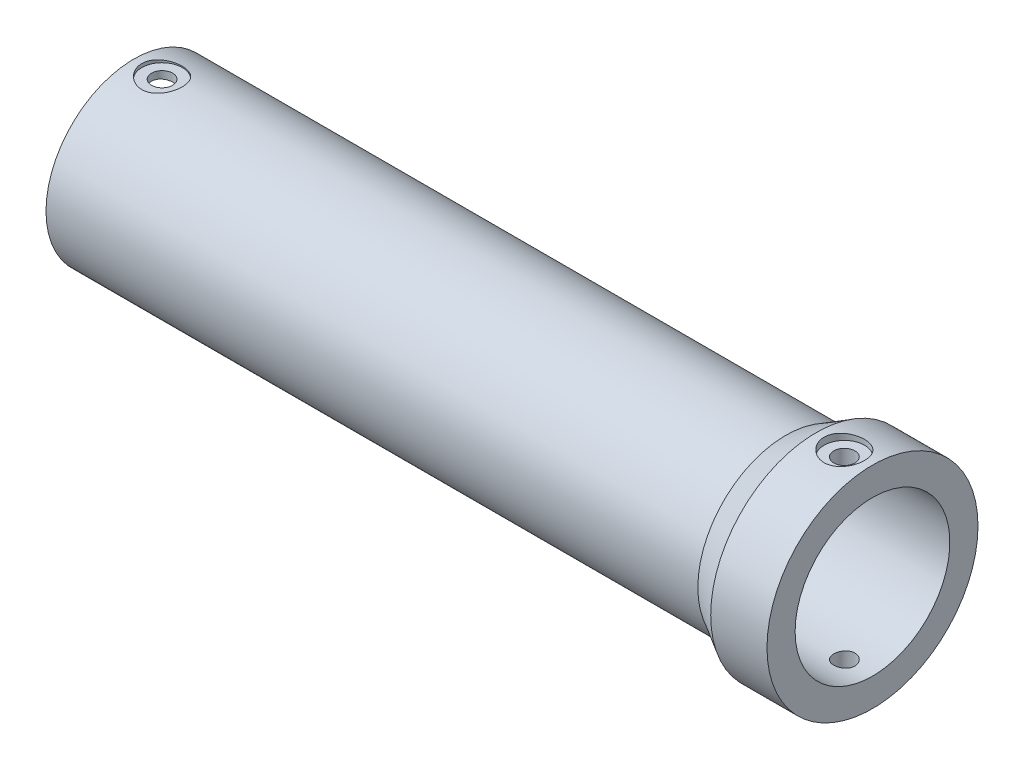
ISO-10303-21;
HEADER;
FILE_DESCRIPTION(('STEP AP214'),'2;1');
FILE_NAME('part.step','',(''),(''),'','','');
FILE_SCHEMA(('AUTOMOTIVE_DESIGN { 1 0 10303 214 1 1 1 1 }'));
ENDSEC;
DATA;
#1=APPLICATION_CONTEXT('core data for automotive mechanical design processes');
#2=APPLICATION_PROTOCOL_DEFINITION('international standard','automotive_design',2000,#1);
#3=PRODUCT_CONTEXT('',#1,'mechanical');
#4=PRODUCT('Part','Part','',(#3));
#5=PRODUCT_RELATED_PRODUCT_CATEGORY('part','',(#4));
#6=PRODUCT_DEFINITION_FORMATION('','',#4);
#7=PRODUCT_DEFINITION_CONTEXT('part definition',#1,'design');
#8=PRODUCT_DEFINITION('design','',#6,#7);
#9=PRODUCT_DEFINITION_SHAPE('','',#8);
#10=(LENGTH_UNIT() NAMED_UNIT(*) SI_UNIT(.MILLI.,.METRE.));
#11=(NAMED_UNIT(*) PLANE_ANGLE_UNIT() SI_UNIT($,.RADIAN.));
#12=(NAMED_UNIT(*) SI_UNIT($,.STERADIAN.) SOLID_ANGLE_UNIT());
#13=UNCERTAINTY_MEASURE_WITH_UNIT(LENGTH_MEASURE(1.E-05),#10,'distance_accuracy_value','');
#14=(GEOMETRIC_REPRESENTATION_CONTEXT(3) GLOBAL_UNCERTAINTY_ASSIGNED_CONTEXT((#13)) GLOBAL_UNIT_ASSIGNED_CONTEXT((#10,
#11,#12)) REPRESENTATION_CONTEXT('',''));
#15=CARTESIAN_POINT('',(0.,0.,0.));
#16=DIRECTION('',(0.,0.,1.));
#17=DIRECTION('',(1.,0.,0.));
#18=AXIS2_PLACEMENT_3D('',#15,#16,#17);
#19=CARTESIAN_POINT('',(4.,-5.,0.));
#20=DIRECTION('',(0.,-1.,0.));
#21=DIRECTION('',(0.,0.,-1.));
#22=AXIS2_PLACEMENT_3D('',#19,#20,#21);
#23=CYLINDRICAL_SURFACE('',#22,1.5);
#24=CARTESIAN_POINT('',(4.,-10.8972473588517,-1.50000000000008));
#25=CARTESIAN_POINT('',(4.08383432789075,-10.8972486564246,-1.49999647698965));
#26=CARTESIAN_POINT('',(4.16771944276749,-10.8982252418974,-1.49294806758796));
#27=CARTESIAN_POINT('',(4.33315047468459,-10.9020240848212,-1.46494465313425));
#28=CARTESIAN_POINT('',(4.41469393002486,-10.9048482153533,-1.44397553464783));
#29=CARTESIAN_POINT('',(4.57302278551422,-10.9120164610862,-1.38876442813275));
#30=CARTESIAN_POINT('',(4.64981155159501,-10.9163594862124,-1.35453195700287));
#31=CARTESIAN_POINT('',(4.79654196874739,-10.9260748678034,-1.27378718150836));
#32=CARTESIAN_POINT('',(4.86648468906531,-10.9314470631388,-1.22727679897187));
#33=CARTESIAN_POINT('',(4.99801459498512,-10.9426553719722,-1.12296630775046));
#34=CARTESIAN_POINT('',(5.05954976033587,-10.9484940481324,-1.06510087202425));
#35=CARTESIAN_POINT('',(5.17206780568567,-10.9599544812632,-0.939863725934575));
#36=CARTESIAN_POINT('',(5.22305013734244,-10.9655762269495,-0.872491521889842));
#37=CARTESIAN_POINT('',(5.31320440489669,-10.9759958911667,-0.729823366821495));
#38=CARTESIAN_POINT('',(5.35232887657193,-10.9807904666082,-0.654497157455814));
#39=CARTESIAN_POINT('',(5.41735256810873,-10.9889873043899,-0.498266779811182));
#40=CARTESIAN_POINT('',(5.44325236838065,-10.9923896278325,-0.417362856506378));
#41=CARTESIAN_POINT('',(5.48093503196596,-10.9974005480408,-0.252807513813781));
#42=CARTESIAN_POINT('',(5.49280469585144,-10.9990201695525,-0.169176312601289));
#43=CARTESIAN_POINT('',(5.50235938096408,-11.0003209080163,-0.00109450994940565));
#44=CARTESIAN_POINT('',(5.50004506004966,-11.0000021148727,0.0833560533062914));
#45=CARTESIAN_POINT('',(5.4813665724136,-10.9974708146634,0.250088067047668));
#46=CARTESIAN_POINT('',(5.46509577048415,-10.9952708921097,0.332380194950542));
#47=CARTESIAN_POINT('',(5.41911239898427,-10.9892385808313,0.493054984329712));
#48=CARTESIAN_POINT('',(5.38939953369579,-10.9854061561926,0.571437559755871));
#49=CARTESIAN_POINT('',(5.31727779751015,-10.9765177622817,0.722354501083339));
#50=CARTESIAN_POINT('',(5.27482899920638,-10.9714579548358,0.794869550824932));
#51=CARTESIAN_POINT('',(5.17846945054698,-10.9606799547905,0.931782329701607));
#52=CARTESIAN_POINT('',(5.12455807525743,-10.9549617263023,0.996179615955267));
#53=CARTESIAN_POINT('',(5.00628199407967,-10.9434509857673,1.11557819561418));
#54=CARTESIAN_POINT('',(4.94183585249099,-10.9376582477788,1.17049882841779));
#55=CARTESIAN_POINT('',(4.80459804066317,-10.9266970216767,1.26875693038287));
#56=CARTESIAN_POINT('',(4.73180633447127,-10.9215285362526,1.31209434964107));
#57=CARTESIAN_POINT('',(4.57986654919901,-10.9124011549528,1.38596314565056));
#58=CARTESIAN_POINT('',(4.50071490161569,-10.9084429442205,1.41648727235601));
#59=CARTESIAN_POINT('',(4.33834296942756,-10.9021970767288,1.46378734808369));
#60=CARTESIAN_POINT('',(4.25512292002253,-10.8999093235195,1.48056409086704));
#61=CARTESIAN_POINT('',(4.08769115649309,-10.8972813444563,1.49978470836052));
#62=CARTESIAN_POINT('',(4.00349274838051,-10.8969256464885,1.50234245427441));
#63=CARTESIAN_POINT('',(3.83586858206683,-10.8981610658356,1.49335366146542));
#64=CARTESIAN_POINT('',(3.75244280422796,-10.8997521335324,1.48180748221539));
#65=CARTESIAN_POINT('',(3.5890782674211,-10.9046876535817,1.44503477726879));
#66=CARTESIAN_POINT('',(3.50912670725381,-10.9080249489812,1.4198640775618));
#67=CARTESIAN_POINT('',(3.35457827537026,-10.9160710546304,1.35661456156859));
#68=CARTESIAN_POINT('',(3.27998162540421,-10.9207799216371,1.31853521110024));
#69=CARTESIAN_POINT('',(3.1377473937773,-10.9310754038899,1.2302721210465));
#70=CARTESIAN_POINT('',(3.07015628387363,-10.9366673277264,1.18001412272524));
#71=CARTESIAN_POINT('',(2.94432749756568,-10.9480824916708,1.06892459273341));
#72=CARTESIAN_POINT('',(2.88609025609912,-10.9539057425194,1.00809256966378));
#73=CARTESIAN_POINT('',(2.78021847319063,-10.9651753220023,0.87708258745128));
#74=CARTESIAN_POINT('',(2.73265903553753,-10.9706188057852,0.806843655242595));
#75=CARTESIAN_POINT('',(2.6500141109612,-10.9804722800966,0.659307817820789));
#76=CARTESIAN_POINT('',(2.61492833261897,-10.9848822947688,0.582011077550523));
#77=CARTESIAN_POINT('',(2.55834897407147,-10.9921593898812,0.422796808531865));
#78=CARTESIAN_POINT('',(2.53681300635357,-10.9950312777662,0.340894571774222));
#79=CARTESIAN_POINT('',(2.50780699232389,-10.9989285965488,0.174594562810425));
#80=CARTESIAN_POINT('',(2.50033618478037,-10.9999541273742,0.090196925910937));
#81=CARTESIAN_POINT('',(2.49968866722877,-11.0000424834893,-0.0779669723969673));
#82=CARTESIAN_POINT('',(2.5063965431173,-10.9991211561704,-0.161732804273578));
#83=CARTESIAN_POINT('',(2.5336702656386,-10.9954510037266,-0.326934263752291));
#84=CARTESIAN_POINT('',(2.55423608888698,-10.9927021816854,-0.408369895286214));
#85=CARTESIAN_POINT('',(2.60860359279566,-10.9856844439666,-0.56657693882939));
#86=CARTESIAN_POINT('',(2.6423986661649,-10.9814162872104,-0.643350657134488));
#87=CARTESIAN_POINT('',(2.72225330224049,-10.9718308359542,-0.790155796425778));
#88=CARTESIAN_POINT('',(2.76831312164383,-10.9665135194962,-0.860187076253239));
#89=CARTESIAN_POINT('',(2.87181278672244,-10.9553706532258,-0.992107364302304));
#90=CARTESIAN_POINT('',(2.92933826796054,-10.9495414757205,-1.05392888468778));
#91=CARTESIAN_POINT('',(3.05395687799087,-10.9380600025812,-1.16708474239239));
#92=CARTESIAN_POINT('',(3.12105225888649,-10.932407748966,-1.2184166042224));
#93=CARTESIAN_POINT('',(3.26326484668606,-10.9218923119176,-1.309343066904));
#94=CARTESIAN_POINT('',(3.33841754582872,-10.9170328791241,-1.34888257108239));
#95=CARTESIAN_POINT('',(3.49432379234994,-10.908697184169,-1.41472146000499));
#96=CARTESIAN_POINT('',(3.57507126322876,-10.905219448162,-1.44103496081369));
#97=CARTESIAN_POINT('',(3.7135113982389,-10.9008677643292,-1.47351601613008));
#98=CARTESIAN_POINT('',(3.77033821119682,-10.8995170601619,-1.48343283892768));
#99=CARTESIAN_POINT('',(3.88476868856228,-10.8977064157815,-1.49667600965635));
#100=CARTESIAN_POINT('',(3.9423723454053,-10.897246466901,-1.50000242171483));
#101=CARTESIAN_POINT('',(4.,-10.8972473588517,-1.50000000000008));
#102=B_SPLINE_CURVE_WITH_KNOTS('',3,(#24,#25,#26,#27,#28,#29,#30,#31,#32,#33,#34,#35,#36,#37,
#38,#39,#40,#41,#42,#43,#44,#45,#46,#47,#48,#49,#50,#51,#52,#53,#54,#55,#56,#57,#58,#59,#60,#61,
#62,#63,#64,#65,#66,#67,#68,#69,#70,#71,#72,#73,#74,#75,#76,#77,#78,#79,#80,#81,#82,#83,#84,#85,
#86,#87,#88,#89,#90,#91,#92,#93,#94,#95,#96,#97,#98,#99,#100,#101),.UNSPECIFIED.,.T.,.F.,(4,2,2,
2,2,2,2,2,2,2,2,2,2,2,2,2,2,2,2,2,2,2,2,2,2,2,2,2,2,2,2,2,2,2,2,2,2,2,4),(0.,0.251292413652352,
0.502839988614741,0.754207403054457,1.00553549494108,1.25835430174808,1.51118624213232,
1.76501723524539,2.01883708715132,2.27107826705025,2.52330774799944,2.77386293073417,
3.02442362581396,3.27577819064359,3.52714646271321,3.78055871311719,4.03397205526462,
4.28752859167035,4.5410704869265,4.7925789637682,5.04408103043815,5.29456029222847,
5.54504992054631,5.79710712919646,6.04917605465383,6.30296596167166,6.55674993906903,
6.80973601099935,7.0627083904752,7.31362951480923,7.56455021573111,7.81534575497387,
8.06614654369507,8.31889590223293,8.57170483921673,8.82567709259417,9.07937770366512,
9.25211760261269,9.42485582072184),.UNSPECIFIED.);
#103=CARTESIAN_POINT('',(4.,-10.8972473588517,-1.50000000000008));
#104=VERTEX_POINT('',#103);
#105=EDGE_CURVE('E89',#104,#104,#102,.T.);
#106=ORIENTED_EDGE('',*,*,#105,.F.);
#107=EDGE_LOOP('',(#106));
#108=FACE_BOUND('',#107,.T.);
#109=CARTESIAN_POINT('',(4.,-12.,0.));
#110=DIRECTION('',(0.,-1.,0.));
#111=DIRECTION('',(0.,0.,-1.));
#112=AXIS2_PLACEMENT_3D('',#109,#110,#111);
#113=CIRCLE('',#112,1.5);
#114=CARTESIAN_POINT('',(4.,-12.,-1.50000000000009));
#115=VERTEX_POINT('',#114);
#116=EDGE_CURVE('E56',#115,#115,#113,.F.);
#117=ORIENTED_EDGE('',*,*,#116,.F.);
#118=EDGE_LOOP('',(#117));
#119=FACE_BOUND('',#118,.T.);
#120=ADVANCED_FACE('F34',(#108,#119),#23,.F.);
#121=CARTESIAN_POINT('',(4.,5.,0.));
#122=DIRECTION('',(0.,1.,0.));
#123=DIRECTION('',(0.,0.,1.));
#124=AXIS2_PLACEMENT_3D('',#121,#122,#123);
#125=CYLINDRICAL_SURFACE('',#124,1.5);
#126=CARTESIAN_POINT('',(4.,10.8972473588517,1.5));
#127=CARTESIAN_POINT('',(4.08383432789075,10.8972486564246,1.49999647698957));
#128=CARTESIAN_POINT('',(4.16771944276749,10.8982252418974,1.49294806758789));
#129=CARTESIAN_POINT('',(4.33315047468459,10.9020240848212,1.46494465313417));
#130=CARTESIAN_POINT('',(4.41469393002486,10.9048482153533,1.44397553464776));
#131=CARTESIAN_POINT('',(4.57302278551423,10.9120164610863,1.38876442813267));
#132=CARTESIAN_POINT('',(4.64981155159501,10.9163594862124,1.35453195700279));
#133=CARTESIAN_POINT('',(4.7965419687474,10.9260748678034,1.27378718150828));
#134=CARTESIAN_POINT('',(4.86648468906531,10.9314470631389,1.2272767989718));
#135=CARTESIAN_POINT('',(4.99801459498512,10.9426553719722,1.12296630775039));
#136=CARTESIAN_POINT('',(5.05954976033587,10.9484940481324,1.06510087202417));
#137=CARTESIAN_POINT('',(5.17206780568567,10.9599544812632,0.939863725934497));
#138=CARTESIAN_POINT('',(5.22305013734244,10.9655762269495,0.872491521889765));
#139=CARTESIAN_POINT('',(5.31320440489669,10.9759958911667,0.729823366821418));
#140=CARTESIAN_POINT('',(5.35232887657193,10.9807904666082,0.654497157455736));
#141=CARTESIAN_POINT('',(5.41735256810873,10.9889873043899,0.498266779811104));
#142=CARTESIAN_POINT('',(5.44325236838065,10.9923896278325,0.417362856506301));
#143=CARTESIAN_POINT('',(5.48093503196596,10.9974005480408,0.252807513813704));
#144=CARTESIAN_POINT('',(5.49280469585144,10.9990201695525,0.169176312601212));
#145=CARTESIAN_POINT('',(5.50235938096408,11.0003209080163,0.00109450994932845));
#146=CARTESIAN_POINT('',(5.50004506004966,11.0000021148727,-0.0833560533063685));
#147=CARTESIAN_POINT('',(5.4813665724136,10.9974708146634,-0.250088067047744));
#148=CARTESIAN_POINT('',(5.46509577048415,10.9952708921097,-0.332380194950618));
#149=CARTESIAN_POINT('',(5.41911239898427,10.9892385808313,-0.493054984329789));
#150=CARTESIAN_POINT('',(5.38939953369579,10.9854061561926,-0.571437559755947));
#151=CARTESIAN_POINT('',(5.31727779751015,10.9765177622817,-0.722354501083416));
#152=CARTESIAN_POINT('',(5.27482899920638,10.9714579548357,-0.794869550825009));
#153=CARTESIAN_POINT('',(5.17846945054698,10.9606799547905,-0.931782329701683));
#154=CARTESIAN_POINT('',(5.12455807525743,10.9549617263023,-0.996179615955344));
#155=CARTESIAN_POINT('',(5.00628199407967,10.9434509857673,-1.11557819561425));
#156=CARTESIAN_POINT('',(4.94183585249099,10.9376582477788,-1.17049882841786));
#157=CARTESIAN_POINT('',(4.80459804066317,10.9266970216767,-1.26875693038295));
#158=CARTESIAN_POINT('',(4.73180633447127,10.9215285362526,-1.31209434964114));
#159=CARTESIAN_POINT('',(4.57986654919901,10.9124011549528,-1.38596314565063));
#160=CARTESIAN_POINT('',(4.50071490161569,10.9084429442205,-1.41648727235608));
#161=CARTESIAN_POINT('',(4.33834296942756,10.9021970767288,-1.46378734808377));
#162=CARTESIAN_POINT('',(4.25512292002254,10.8999093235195,-1.48056409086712));
#163=CARTESIAN_POINT('',(4.08769115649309,10.8972813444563,-1.49978470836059));
#164=CARTESIAN_POINT('',(4.00349274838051,10.8969256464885,-1.50234245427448));
#165=CARTESIAN_POINT('',(3.83586858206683,10.8981610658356,-1.4933536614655));
#166=CARTESIAN_POINT('',(3.75244280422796,10.8997521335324,-1.48180748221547));
#167=CARTESIAN_POINT('',(3.5890782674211,10.9046876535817,-1.44503477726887));
#168=CARTESIAN_POINT('',(3.50912670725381,10.9080249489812,-1.41986407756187));
#169=CARTESIAN_POINT('',(3.35457827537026,10.9160710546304,-1.35661456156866));
#170=CARTESIAN_POINT('',(3.27998162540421,10.9207799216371,-1.31853521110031));
#171=CARTESIAN_POINT('',(3.1377473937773,10.9310754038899,-1.23027212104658));
#172=CARTESIAN_POINT('',(3.07015628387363,10.9366673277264,-1.18001412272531));
#173=CARTESIAN_POINT('',(2.94432749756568,10.9480824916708,-1.06892459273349));
#174=CARTESIAN_POINT('',(2.88609025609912,10.9539057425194,-1.00809256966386));
#175=CARTESIAN_POINT('',(2.78021847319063,10.9651753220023,-0.877082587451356));
#176=CARTESIAN_POINT('',(2.73265903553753,10.9706188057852,-0.806843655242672));
#177=CARTESIAN_POINT('',(2.6500141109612,10.9804722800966,-0.659307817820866));
#178=CARTESIAN_POINT('',(2.61492833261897,10.9848822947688,-0.5820110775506));
#179=CARTESIAN_POINT('',(2.55834897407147,10.9921593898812,-0.422796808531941));
#180=CARTESIAN_POINT('',(2.53681300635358,10.9950312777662,-0.340894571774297));
#181=CARTESIAN_POINT('',(2.50780699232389,10.9989285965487,-0.174594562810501));
#182=CARTESIAN_POINT('',(2.50033618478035,10.9999541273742,-0.090196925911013));
#183=CARTESIAN_POINT('',(2.49968866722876,11.0000424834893,0.0779669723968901));
#184=CARTESIAN_POINT('',(2.5063965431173,10.9991211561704,0.1617328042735));
#185=CARTESIAN_POINT('',(2.5336702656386,10.9954510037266,0.326934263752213));
#186=CARTESIAN_POINT('',(2.55423608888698,10.9927021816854,0.408369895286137));
#187=CARTESIAN_POINT('',(2.60860359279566,10.9856844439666,0.566576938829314));
#188=CARTESIAN_POINT('',(2.6423986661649,10.9814162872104,0.643350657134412));
#189=CARTESIAN_POINT('',(2.72225330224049,10.9718308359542,0.790155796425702));
#190=CARTESIAN_POINT('',(2.76831312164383,10.9665135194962,0.860187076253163));
#191=CARTESIAN_POINT('',(2.87181278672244,10.9553706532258,0.992107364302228));
#192=CARTESIAN_POINT('',(2.92933826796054,10.9495414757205,1.05392888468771));
#193=CARTESIAN_POINT('',(3.05395687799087,10.9380600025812,1.16708474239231));
#194=CARTESIAN_POINT('',(3.12105225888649,10.932407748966,1.21841660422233));
#195=CARTESIAN_POINT('',(3.26326484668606,10.9218923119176,1.30934306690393));
#196=CARTESIAN_POINT('',(3.33841754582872,10.9170328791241,1.34888257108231));
#197=CARTESIAN_POINT('',(3.49432379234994,10.908697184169,1.41472146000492));
#198=CARTESIAN_POINT('',(3.57507126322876,10.9052194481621,1.44103496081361));
#199=CARTESIAN_POINT('',(3.7135113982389,10.9008677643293,1.47351601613));
#200=CARTESIAN_POINT('',(3.77033821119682,10.899517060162,1.4834328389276));
#201=CARTESIAN_POINT('',(3.88476868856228,10.8977064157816,1.49667600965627));
#202=CARTESIAN_POINT('',(3.9423723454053,10.8972464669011,1.50000242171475));
#203=CARTESIAN_POINT('',(4.,10.8972473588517,1.5));
#204=B_SPLINE_CURVE_WITH_KNOTS('',3,(#126,#127,#128,#129,#130,#131,#132,#133,#134,#135,#136,
#137,#138,#139,#140,#141,#142,#143,#144,#145,#146,#147,#148,#149,#150,#151,#152,#153,#154,#155,
#156,#157,#158,#159,#160,#161,#162,#163,#164,#165,#166,#167,#168,#169,#170,#171,#172,#173,#174,
#175,#176,#177,#178,#179,#180,#181,#182,#183,#184,#185,#186,#187,#188,#189,#190,#191,#192,#193,
#194,#195,#196,#197,#198,#199,#200,#201,#202,#203),.UNSPECIFIED.,.T.,.F.,(4,2,2,2,2,2,2,2,2,2,2,
2,2,2,2,2,2,2,2,2,2,2,2,2,2,2,2,2,2,2,2,2,2,2,2,2,2,2,4),(0.,0.251292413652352,
0.502839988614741,0.754207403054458,1.00553549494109,1.25835430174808,1.51118624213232,
1.76501723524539,2.01883708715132,2.27107826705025,2.52330774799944,2.77386293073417,
3.02442362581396,3.27577819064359,3.52714646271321,3.78055871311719,4.03397205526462,
4.28752859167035,4.5410704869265,4.7925789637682,5.04408103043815,5.29456029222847,
5.54504992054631,5.79710712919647,6.04917605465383,6.30296596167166,6.55674993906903,
6.80973601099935,7.0627083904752,7.31362951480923,7.56455021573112,7.81534575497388,
8.06614654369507,8.31889590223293,8.57170483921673,8.82567709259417,9.07937770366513,
9.2521176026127,9.42485582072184),.UNSPECIFIED.);
#205=CARTESIAN_POINT('',(4.,10.8972473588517,1.5));
#206=VERTEX_POINT('',#205);
#207=EDGE_CURVE('E194',#206,#206,#204,.T.);
#208=ORIENTED_EDGE('',*,*,#207,.F.);
#209=EDGE_LOOP('',(#208));
#210=FACE_BOUND('',#209,.T.);
#211=CARTESIAN_POINT('',(4.,12.,0.));
#212=DIRECTION('',(0.,1.,0.));
#213=DIRECTION('',(0.,0.,1.));
#214=AXIS2_PLACEMENT_3D('',#211,#212,#213);
#215=CIRCLE('',#214,1.5);
#216=CARTESIAN_POINT('',(4.,12.,1.5));
#217=VERTEX_POINT('',#216);
#218=EDGE_CURVE('E86',#217,#217,#215,.F.);
#219=ORIENTED_EDGE('',*,*,#218,.F.);
#220=EDGE_LOOP('',(#219));
#221=FACE_BOUND('',#220,.T.);
#222=ADVANCED_FACE('F115',(#210,#221),#125,.F.);
#223=CARTESIAN_POINT('',(101.,-3.,0.));
#224=DIRECTION('',(0.,-1.,0.));
#225=DIRECTION('',(0.,0.,-1.));
#226=AXIS2_PLACEMENT_3D('',#223,#224,#225);
#227=CYLINDRICAL_SURFACE('',#226,1.5);
#228=CARTESIAN_POINT('',(101.,-10.8972473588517,-1.50000000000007));
#229=CARTESIAN_POINT('',(101.083834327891,-10.8972486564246,-1.49999647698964));
#230=CARTESIAN_POINT('',(101.167719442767,-10.8982252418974,-1.49294806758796));
#231=CARTESIAN_POINT('',(101.333150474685,-10.9020240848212,-1.46494465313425));
#232=CARTESIAN_POINT('',(101.414693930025,-10.9048482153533,-1.44397553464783));
#233=CARTESIAN_POINT('',(101.573022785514,-10.9120164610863,-1.38876442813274));
#234=CARTESIAN_POINT('',(101.649811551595,-10.9163594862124,-1.35453195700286));
#235=CARTESIAN_POINT('',(101.796541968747,-10.9260748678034,-1.27378718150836));
#236=CARTESIAN_POINT('',(101.866484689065,-10.9314470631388,-1.22727679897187));
#237=CARTESIAN_POINT('',(101.998014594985,-10.9426553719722,-1.12296630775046));
#238=CARTESIAN_POINT('',(102.059549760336,-10.9484940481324,-1.06510087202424));
#239=CARTESIAN_POINT('',(102.172067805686,-10.9599544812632,-0.939863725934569));
#240=CARTESIAN_POINT('',(102.223050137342,-10.9655762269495,-0.872491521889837));
#241=CARTESIAN_POINT('',(102.313204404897,-10.9759958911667,-0.729823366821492));
#242=CARTESIAN_POINT('',(102.352328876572,-10.9807904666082,-0.654497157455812));
#243=CARTESIAN_POINT('',(102.417352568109,-10.9889873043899,-0.498266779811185));
#244=CARTESIAN_POINT('',(102.443252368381,-10.9923896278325,-0.417362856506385));
#245=CARTESIAN_POINT('',(102.480935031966,-10.9974005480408,-0.252807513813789));
#246=CARTESIAN_POINT('',(102.492804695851,-10.9990201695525,-0.169176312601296));
#247=CARTESIAN_POINT('',(102.502359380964,-11.0003209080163,-0.0010945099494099));
#248=CARTESIAN_POINT('',(102.50004506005,-11.0000021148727,0.0833560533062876));
#249=CARTESIAN_POINT('',(102.481366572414,-10.9974708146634,0.250088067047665));
#250=CARTESIAN_POINT('',(102.465095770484,-10.9952708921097,0.332380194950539));
#251=CARTESIAN_POINT('',(102.419112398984,-10.9892385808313,0.493054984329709));
#252=CARTESIAN_POINT('',(102.389399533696,-10.9854061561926,0.571437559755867));
#253=CARTESIAN_POINT('',(102.31727779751,-10.9765177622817,0.722354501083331));
#254=CARTESIAN_POINT('',(102.274828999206,-10.9714579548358,0.794869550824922));
#255=CARTESIAN_POINT('',(102.178469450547,-10.9606799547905,0.931782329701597));
#256=CARTESIAN_POINT('',(102.124558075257,-10.9549617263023,0.99617961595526));
#257=CARTESIAN_POINT('',(102.00628199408,-10.9434509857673,1.11557819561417));
#258=CARTESIAN_POINT('',(101.941835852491,-10.9376582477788,1.17049882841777));
#259=CARTESIAN_POINT('',(101.804598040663,-10.9266970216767,1.26875693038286));
#260=CARTESIAN_POINT('',(101.731806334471,-10.9215285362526,1.31209434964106));
#261=CARTESIAN_POINT('',(101.579866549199,-10.9124011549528,1.38596314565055));
#262=CARTESIAN_POINT('',(101.500714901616,-10.9084429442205,1.41648727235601));
#263=CARTESIAN_POINT('',(101.338342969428,-10.9021970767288,1.46378734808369));
#264=CARTESIAN_POINT('',(101.255122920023,-10.8999093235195,1.48056409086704));
#265=CARTESIAN_POINT('',(101.087691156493,-10.8972813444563,1.49978470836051));
#266=CARTESIAN_POINT('',(101.003492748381,-10.8969256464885,1.5023424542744));
#267=CARTESIAN_POINT('',(100.835868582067,-10.8981610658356,1.49335366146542));
#268=CARTESIAN_POINT('',(100.752442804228,-10.8997521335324,1.48180748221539));
#269=CARTESIAN_POINT('',(100.589078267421,-10.9046876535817,1.44503477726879));
#270=CARTESIAN_POINT('',(100.509126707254,-10.9080249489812,1.4198640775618));
#271=CARTESIAN_POINT('',(100.35457827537,-10.9160710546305,1.35661456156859));
#272=CARTESIAN_POINT('',(100.279981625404,-10.9207799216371,1.31853521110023));
#273=CARTESIAN_POINT('',(100.137747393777,-10.9310754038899,1.2302721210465));
#274=CARTESIAN_POINT('',(100.070156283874,-10.9366673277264,1.18001412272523));
#275=CARTESIAN_POINT('',(99.9443274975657,-10.9480824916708,1.06892459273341));
#276=CARTESIAN_POINT('',(99.8860902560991,-10.9539057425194,1.00809256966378));
#277=CARTESIAN_POINT('',(99.7802184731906,-10.9651753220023,0.877082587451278));
#278=CARTESIAN_POINT('',(99.7326590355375,-10.9706188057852,0.806843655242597));
#279=CARTESIAN_POINT('',(99.6500141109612,-10.9804722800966,0.659307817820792));
#280=CARTESIAN_POINT('',(99.614928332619,-10.9848822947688,0.582011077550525));
#281=CARTESIAN_POINT('',(99.5583489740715,-10.9921593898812,0.422796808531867));
#282=CARTESIAN_POINT('',(99.5368130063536,-10.9950312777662,0.340894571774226));
#283=CARTESIAN_POINT('',(99.5078069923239,-10.9989285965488,0.17459456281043));
#284=CARTESIAN_POINT('',(99.5003361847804,-10.9999541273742,0.0901969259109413));
#285=CARTESIAN_POINT('',(99.4996886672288,-11.0000424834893,-0.0779669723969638));
#286=CARTESIAN_POINT('',(99.5063965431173,-10.9991211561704,-0.161732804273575));
#287=CARTESIAN_POINT('',(99.5336702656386,-10.9954510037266,-0.326934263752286));
#288=CARTESIAN_POINT('',(99.554236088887,-10.9927021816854,-0.408369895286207));
#289=CARTESIAN_POINT('',(99.6086035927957,-10.9856844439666,-0.566576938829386));
#290=CARTESIAN_POINT('',(99.6423986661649,-10.9814162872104,-0.643350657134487));
#291=CARTESIAN_POINT('',(99.7222533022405,-10.9718308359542,-0.790155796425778));
#292=CARTESIAN_POINT('',(99.7683131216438,-10.9665135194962,-0.860187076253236));
#293=CARTESIAN_POINT('',(99.8718127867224,-10.9553706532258,-0.992107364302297));
#294=CARTESIAN_POINT('',(99.9293382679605,-10.9495414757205,-1.05392888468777));
#295=CARTESIAN_POINT('',(100.053956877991,-10.9380600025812,-1.16708474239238));
#296=CARTESIAN_POINT('',(100.121052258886,-10.932407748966,-1.2184166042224));
#297=CARTESIAN_POINT('',(100.263264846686,-10.9218923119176,-1.309343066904));
#298=CARTESIAN_POINT('',(100.338417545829,-10.9170328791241,-1.34888257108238));
#299=CARTESIAN_POINT('',(100.49432379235,-10.908697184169,-1.41472146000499));
#300=CARTESIAN_POINT('',(100.575071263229,-10.905219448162,-1.44103496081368));
#301=CARTESIAN_POINT('',(100.713511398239,-10.9008677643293,-1.47351601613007));
#302=CARTESIAN_POINT('',(100.770338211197,-10.8995170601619,-1.48343283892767));
#303=CARTESIAN_POINT('',(100.884768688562,-10.8977064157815,-1.49667600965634));
#304=CARTESIAN_POINT('',(100.942372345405,-10.897246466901,-1.50000242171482));
#305=CARTESIAN_POINT('',(101.,-10.8972473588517,-1.50000000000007));
#306=B_SPLINE_CURVE_WITH_KNOTS('',3,(#228,#229,#230,#231,#232,#233,#234,#235,#236,#237,#238,
#239,#240,#241,#242,#243,#244,#245,#246,#247,#248,#249,#250,#251,#252,#253,#254,#255,#256,#257,
#258,#259,#260,#261,#262,#263,#264,#265,#266,#267,#268,#269,#270,#271,#272,#273,#274,#275,#276,
#277,#278,#279,#280,#281,#282,#283,#284,#285,#286,#287,#288,#289,#290,#291,#292,#293,#294,#295,
#296,#297,#298,#299,#300,#301,#302,#303,#304,#305),.UNSPECIFIED.,.T.,.F.,(4,2,2,2,2,2,2,2,2,2,2,
2,2,2,2,2,2,2,2,2,2,2,2,2,2,2,2,2,2,2,2,2,2,2,2,2,2,2,4),(0.,0.251292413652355,
0.502839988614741,0.754207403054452,1.00553549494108,1.25835430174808,1.51118624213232,
1.76501723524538,2.01883708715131,2.27107826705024,2.52330774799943,2.77386293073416,
3.02442362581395,3.27577819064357,3.52714646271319,3.78055871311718,4.0339720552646,
4.28752859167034,4.54107048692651,4.79257896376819,5.04408103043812,5.29456029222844,
5.5450499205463,5.79710712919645,6.04917605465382,6.30296596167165,6.556749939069,
6.80973601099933,7.06270839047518,7.31362951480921,7.5645502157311,7.81534575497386,
8.06614654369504,8.3188959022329,8.57170483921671,8.82567709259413,9.0793777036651,
9.25211760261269,9.42485582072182),.UNSPECIFIED.);
#307=CARTESIAN_POINT('',(101.,-10.8972473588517,-1.50000000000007));
#308=VERTEX_POINT('',#307);
#309=EDGE_CURVE('E118',#308,#308,#306,.T.);
#310=ORIENTED_EDGE('',*,*,#309,.F.);
#311=EDGE_LOOP('',(#310));
#312=FACE_BOUND('',#311,.T.);
#313=CARTESIAN_POINT('',(101.,-14.,0.));
#314=DIRECTION('',(0.,-1.,0.));
#315=DIRECTION('',(0.,0.,-1.));
#316=AXIS2_PLACEMENT_3D('',#313,#314,#315);
#317=CIRCLE('',#316,1.5);
#318=CARTESIAN_POINT('',(101.,-14.,-1.5000000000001));
#319=VERTEX_POINT('',#318);
#320=EDGE_CURVE('E98',#319,#319,#317,.F.);
#321=ORIENTED_EDGE('',*,*,#320,.F.);
#322=EDGE_LOOP('',(#321));
#323=FACE_BOUND('',#322,.T.);
#324=ADVANCED_FACE('F110',(#312,#323),#227,.F.);
#325=CARTESIAN_POINT('',(101.,2.99999999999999,0.));
#326=DIRECTION('',(0.,1.,0.));
#327=DIRECTION('',(0.,0.,1.));
#328=AXIS2_PLACEMENT_3D('',#325,#326,#327);
#329=CYLINDRICAL_SURFACE('',#328,1.5);
#330=CARTESIAN_POINT('',(101.,10.8972473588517,1.5));
#331=CARTESIAN_POINT('',(101.083834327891,10.8972486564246,1.49999647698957));
#332=CARTESIAN_POINT('',(101.167719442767,10.8982252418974,1.49294806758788));
#333=CARTESIAN_POINT('',(101.333150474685,10.9020240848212,1.46494465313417));
#334=CARTESIAN_POINT('',(101.414693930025,10.9048482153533,1.44397553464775));
#335=CARTESIAN_POINT('',(101.573022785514,10.9120164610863,1.38876442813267));
#336=CARTESIAN_POINT('',(101.649811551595,10.9163594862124,1.35453195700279));
#337=CARTESIAN_POINT('',(101.796541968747,10.9260748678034,1.27378718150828));
#338=CARTESIAN_POINT('',(101.866484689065,10.9314470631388,1.2272767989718));
#339=CARTESIAN_POINT('',(101.998014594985,10.9426553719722,1.12296630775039));
#340=CARTESIAN_POINT('',(102.059549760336,10.9484940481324,1.06510087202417));
#341=CARTESIAN_POINT('',(102.172067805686,10.9599544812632,0.939863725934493));
#342=CARTESIAN_POINT('',(102.223050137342,10.9655762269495,0.872491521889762));
#343=CARTESIAN_POINT('',(102.313204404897,10.9759958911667,0.729823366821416));
#344=CARTESIAN_POINT('',(102.352328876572,10.9807904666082,0.654497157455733));
#345=CARTESIAN_POINT('',(102.417352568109,10.9889873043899,0.498266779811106));
#346=CARTESIAN_POINT('',(102.443252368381,10.9923896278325,0.417362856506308));
#347=CARTESIAN_POINT('',(102.480935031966,10.9974005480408,0.252807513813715));
#348=CARTESIAN_POINT('',(102.492804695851,10.9990201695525,0.169176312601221));
#349=CARTESIAN_POINT('',(102.502359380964,11.0003209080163,0.0010945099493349));
#350=CARTESIAN_POINT('',(102.50004506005,11.0000021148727,-0.0833560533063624));
#351=CARTESIAN_POINT('',(102.481366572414,10.9974708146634,-0.250088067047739));
#352=CARTESIAN_POINT('',(102.465095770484,10.9952708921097,-0.332380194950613));
#353=CARTESIAN_POINT('',(102.419112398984,10.9892385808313,-0.493054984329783));
#354=CARTESIAN_POINT('',(102.389399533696,10.9854061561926,-0.571437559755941));
#355=CARTESIAN_POINT('',(102.31727779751,10.9765177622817,-0.722354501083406));
#356=CARTESIAN_POINT('',(102.274828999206,10.9714579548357,-0.794869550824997));
#357=CARTESIAN_POINT('',(102.178469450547,10.9606799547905,-0.931782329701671));
#358=CARTESIAN_POINT('',(102.124558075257,10.9549617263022,-0.996179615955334));
#359=CARTESIAN_POINT('',(102.00628199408,10.9434509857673,-1.11557819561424));
#360=CARTESIAN_POINT('',(101.941835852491,10.9376582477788,-1.17049882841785));
#361=CARTESIAN_POINT('',(101.804598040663,10.9266970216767,-1.26875693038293));
#362=CARTESIAN_POINT('',(101.731806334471,10.9215285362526,-1.31209434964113));
#363=CARTESIAN_POINT('',(101.579866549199,10.9124011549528,-1.38596314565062));
#364=CARTESIAN_POINT('',(101.500714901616,10.9084429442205,-1.41648727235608));
#365=CARTESIAN_POINT('',(101.338342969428,10.9021970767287,-1.46378734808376));
#366=CARTESIAN_POINT('',(101.255122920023,10.8999093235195,-1.48056409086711));
#367=CARTESIAN_POINT('',(101.087691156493,10.8972813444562,-1.49978470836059));
#368=CARTESIAN_POINT('',(101.003492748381,10.8969256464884,-1.50234245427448));
#369=CARTESIAN_POINT('',(100.835868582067,10.8981610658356,-1.49335366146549));
#370=CARTESIAN_POINT('',(100.752442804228,10.8997521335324,-1.48180748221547));
#371=CARTESIAN_POINT('',(100.589078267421,10.9046876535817,-1.44503477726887));
#372=CARTESIAN_POINT('',(100.509126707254,10.9080249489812,-1.41986407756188));
#373=CARTESIAN_POINT('',(100.35457827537,10.9160710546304,-1.35661456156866));
#374=CARTESIAN_POINT('',(100.279981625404,10.9207799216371,-1.31853521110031));
#375=CARTESIAN_POINT('',(100.137747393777,10.9310754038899,-1.23027212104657));
#376=CARTESIAN_POINT('',(100.070156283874,10.9366673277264,-1.18001412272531));
#377=CARTESIAN_POINT('',(99.9443274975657,10.9480824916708,-1.06892459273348));
#378=CARTESIAN_POINT('',(99.8860902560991,10.9539057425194,-1.00809256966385));
#379=CARTESIAN_POINT('',(99.7802184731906,10.9651753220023,-0.877082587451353));
#380=CARTESIAN_POINT('',(99.7326590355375,10.9706188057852,-0.806843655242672));
#381=CARTESIAN_POINT('',(99.6500141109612,10.9804722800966,-0.659307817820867));
#382=CARTESIAN_POINT('',(99.614928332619,10.9848822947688,-0.5820110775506));
#383=CARTESIAN_POINT('',(99.5583489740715,10.9921593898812,-0.422796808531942));
#384=CARTESIAN_POINT('',(99.5368130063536,10.9950312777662,-0.340894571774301));
#385=CARTESIAN_POINT('',(99.5078069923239,10.9989285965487,-0.174594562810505));
#386=CARTESIAN_POINT('',(99.5003361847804,10.9999541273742,-0.0901969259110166));
#387=CARTESIAN_POINT('',(99.4996886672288,11.0000424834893,0.0779669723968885));
#388=CARTESIAN_POINT('',(99.5063965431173,10.9991211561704,0.161732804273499));
#389=CARTESIAN_POINT('',(99.5336702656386,10.9954510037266,0.326934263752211));
#390=CARTESIAN_POINT('',(99.554236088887,10.9927021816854,0.408369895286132));
#391=CARTESIAN_POINT('',(99.6086035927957,10.9856844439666,0.566576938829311));
#392=CARTESIAN_POINT('',(99.6423986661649,10.9814162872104,0.643350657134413));
#393=CARTESIAN_POINT('',(99.7222533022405,10.9718308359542,0.790155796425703));
#394=CARTESIAN_POINT('',(99.7683131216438,10.9665135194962,0.860187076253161));
#395=CARTESIAN_POINT('',(99.8718127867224,10.9553706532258,0.992107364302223));
#396=CARTESIAN_POINT('',(99.9293382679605,10.9495414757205,1.0539288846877));
#397=CARTESIAN_POINT('',(100.053956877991,10.9380600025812,1.16708474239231));
#398=CARTESIAN_POINT('',(100.121052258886,10.932407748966,1.21841660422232));
#399=CARTESIAN_POINT('',(100.263264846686,10.9218923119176,1.30934306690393));
#400=CARTESIAN_POINT('',(100.338417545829,10.9170328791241,1.34888257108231));
#401=CARTESIAN_POINT('',(100.49432379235,10.908697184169,1.41472146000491));
#402=CARTESIAN_POINT('',(100.575071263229,10.905219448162,1.44103496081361));
#403=CARTESIAN_POINT('',(100.713511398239,10.9008677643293,1.47351601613));
#404=CARTESIAN_POINT('',(100.770338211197,10.8995170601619,1.4834328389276));
#405=CARTESIAN_POINT('',(100.884768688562,10.8977064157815,1.49667600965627));
#406=CARTESIAN_POINT('',(100.942372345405,10.897246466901,1.50000242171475));
#407=CARTESIAN_POINT('',(101.,10.8972473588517,1.5));
#408=B_SPLINE_CURVE_WITH_KNOTS('',3,(#330,#331,#332,#333,#334,#335,#336,#337,#338,#339,#340,
#341,#342,#343,#344,#345,#346,#347,#348,#349,#350,#351,#352,#353,#354,#355,#356,#357,#358,#359,
#360,#361,#362,#363,#364,#365,#366,#367,#368,#369,#370,#371,#372,#373,#374,#375,#376,#377,#378,
#379,#380,#381,#382,#383,#384,#385,#386,#387,#388,#389,#390,#391,#392,#393,#394,#395,#396,#397,
#398,#399,#400,#401,#402,#403,#404,#405,#406,#407),.UNSPECIFIED.,.T.,.F.,(4,2,2,2,2,2,2,2,2,2,2,
2,2,2,2,2,2,2,2,2,2,2,2,2,2,2,2,2,2,2,2,2,2,2,2,2,2,2,4),(0.,0.251292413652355,
0.502839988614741,0.754207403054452,1.00553549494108,1.25835430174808,1.51118624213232,
1.76501723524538,2.01883708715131,2.27107826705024,2.52330774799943,2.77386293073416,
3.02442362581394,3.27577819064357,3.52714646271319,3.78055871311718,4.0339720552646,
4.28752859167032,4.54107048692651,4.79257896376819,5.04408103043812,5.29456029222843,
5.5450499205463,5.79710712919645,6.04917605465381,6.30296596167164,6.556749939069,
6.80973601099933,7.06270839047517,7.31362951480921,7.56455021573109,7.81534575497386,
8.06614654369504,8.3188959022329,8.5717048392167,8.82567709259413,9.0793777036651,
9.25211760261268,9.42485582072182),.UNSPECIFIED.);
#409=CARTESIAN_POINT('',(101.,10.8972473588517,1.5));
#410=VERTEX_POINT('',#409);
#411=EDGE_CURVE('E140',#410,#410,#408,.T.);
#412=ORIENTED_EDGE('',*,*,#411,.F.);
#413=EDGE_LOOP('',(#412));
#414=FACE_BOUND('',#413,.T.);
#415=CARTESIAN_POINT('',(101.,14.,0.));
#416=DIRECTION('',(0.,1.,0.));
#417=DIRECTION('',(0.,0.,1.));
#418=AXIS2_PLACEMENT_3D('',#415,#416,#417);
#419=CIRCLE('',#418,1.5);
#420=CARTESIAN_POINT('',(101.,14.,1.5));
#421=VERTEX_POINT('',#420);
#422=EDGE_CURVE('E147',#421,#421,#419,.F.);
#423=ORIENTED_EDGE('',*,*,#422,.F.);
#424=EDGE_LOOP('',(#423));
#425=FACE_BOUND('',#424,.T.);
#426=ADVANCED_FACE('F114',(#414,#425),#329,.F.);
#427=CARTESIAN_POINT('',(97.,0.,0.));
#428=DIRECTION('',(1.,0.,0.));
#429=DIRECTION('',(0.,0.,-1.));
#430=AXIS2_PLACEMENT_3D('',#427,#428,#429);
#431=CONICAL_SURFACE('',#430,15.,0.523598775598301);
#432=CARTESIAN_POINT('',(92.6698729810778,0.,0.));
#433=DIRECTION('',(-1.,0.,0.));
#434=DIRECTION('',(0.,0.,1.));
#435=AXIS2_PLACEMENT_3D('',#432,#433,#434);
#436=CIRCLE('',#435,12.5);
#437=CARTESIAN_POINT('',(92.6698729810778,0.,12.5));
#438=VERTEX_POINT('',#437);
#439=EDGE_CURVE('E146',#438,#438,#436,.T.);
#440=ORIENTED_EDGE('',*,*,#439,.F.);
#441=EDGE_LOOP('',(#440));
#442=FACE_BOUND('',#441,.T.);
#443=CARTESIAN_POINT('',(97.,0.,0.));
#444=DIRECTION('',(-1.,0.,0.));
#445=DIRECTION('',(0.,0.,1.));
#446=AXIS2_PLACEMENT_3D('',#443,#444,#445);
#447=CIRCLE('',#446,15.);
#448=CARTESIAN_POINT('',(97.,0.,15.));
#449=VERTEX_POINT('',#448);
#450=EDGE_CURVE('E148',#449,#449,#447,.T.);
#451=ORIENTED_EDGE('',*,*,#450,.T.);
#452=EDGE_LOOP('',(#451));
#453=FACE_BOUND('',#452,.T.);
#454=ADVANCED_FACE('F36',(#442,#453),#431,.T.);
#455=CARTESIAN_POINT('',(0.,0.,0.));
#456=DIRECTION('',(-1.,0.,0.));
#457=DIRECTION('',(0.,0.,1.));
#458=AXIS2_PLACEMENT_3D('',#455,#456,#457);
#459=CYLINDRICAL_SURFACE('',#458,15.);
#460=CARTESIAN_POINT('',(101.,-14.7219012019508,-2.87500000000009));
#461=CARTESIAN_POINT('',(100.840109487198,-14.7219043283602,-2.87499393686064));
#462=CARTESIAN_POINT('',(100.680141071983,-14.7245342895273,-2.86161648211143));
#463=CARTESIAN_POINT('',(100.364719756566,-14.7347561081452,-2.8084989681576));
#464=CARTESIAN_POINT('',(100.209270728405,-14.7423520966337,-2.7687369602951));
#465=CARTESIAN_POINT('',(99.9074975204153,-14.7616147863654,-2.66412031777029));
#466=CARTESIAN_POINT('',(99.7611648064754,-14.7732776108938,-2.59928957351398));
#467=CARTESIAN_POINT('',(99.4814604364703,-14.7993552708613,-2.4464397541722));
#468=CARTESIAN_POINT('',(99.3480878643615,-14.8137699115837,-2.35842231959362));
#469=CARTESIAN_POINT('',(99.0963471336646,-14.8439363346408,-2.16047809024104));
#470=CARTESIAN_POINT('',(98.9781719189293,-14.8597017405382,-2.05030795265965));
#471=CARTESIAN_POINT('',(98.7618626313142,-14.8906731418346,-1.81171151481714));
#472=CARTESIAN_POINT('',(98.6637299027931,-14.9058790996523,-1.68328399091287));
#473=CARTESIAN_POINT('',(98.4895487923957,-14.934164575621,-1.41054764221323));
#474=CARTESIAN_POINT('',(98.4136827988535,-14.9472261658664,-1.26612031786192));
#475=CARTESIAN_POINT('',(98.287364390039,-14.9695985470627,-0.966277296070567));
#476=CARTESIAN_POINT('',(98.2369097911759,-14.9789096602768,-0.810862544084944));
#477=CARTESIAN_POINT('',(98.1634443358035,-14.9926357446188,-0.495456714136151));
#478=CARTESIAN_POINT('',(98.1401080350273,-14.9971087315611,-0.335544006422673));
#479=CARTESIAN_POINT('',(98.1205271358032,-15.0008546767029,-0.0140147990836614));
#480=CARTESIAN_POINT('',(98.1242801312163,-15.000128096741,0.147601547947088));
#481=CARTESIAN_POINT('',(98.158522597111,-14.9936019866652,0.465717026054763));
#482=CARTESIAN_POINT('',(98.188661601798,-14.9878689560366,0.622255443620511));
#483=CARTESIAN_POINT('',(98.2742657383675,-14.9720488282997,0.928011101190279));
#484=CARTESIAN_POINT('',(98.32973182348,-14.9619615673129,1.07722806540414));
#485=CARTESIAN_POINT('',(98.4647465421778,-14.9384557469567,1.36511617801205));
#486=CARTESIAN_POINT('',(98.5444343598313,-14.9250180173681,1.50372042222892));
#487=CARTESIAN_POINT('',(98.7255278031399,-14.8962958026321,1.76572021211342));
#488=CARTESIAN_POINT('',(98.8269357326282,-14.8810111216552,1.88911414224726));
#489=CARTESIAN_POINT('',(99.0505192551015,-14.8499975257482,2.11926820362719));
#490=CARTESIAN_POINT('',(99.1730014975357,-14.8342654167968,2.22573022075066));
#491=CARTESIAN_POINT('',(99.4342377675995,-14.8043635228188,2.41664789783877));
#492=CARTESIAN_POINT('',(99.5729920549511,-14.7901937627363,2.50110320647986));
#493=CARTESIAN_POINT('',(99.8632396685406,-14.7650157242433,2.6457008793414));
#494=CARTESIAN_POINT('',(100.014755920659,-14.7540132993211,2.70579831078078));
#495=CARTESIAN_POINT('',(100.325993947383,-14.7365040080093,2.79959804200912));
#496=CARTESIAN_POINT('',(100.485714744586,-14.7299966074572,2.83330347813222));
#497=CARTESIAN_POINT('',(100.806135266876,-14.7223202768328,2.87292383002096));
#498=CARTESIAN_POINT('',(100.966780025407,-14.7210689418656,2.87926776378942));
#499=CARTESIAN_POINT('',(101.28683304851,-14.7238256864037,2.86513650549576));
#500=CARTESIAN_POINT('',(101.44624137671,-14.7278334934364,2.84466270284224));
#501=CARTESIAN_POINT('',(101.757875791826,-14.7405800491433,2.77784596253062));
#502=CARTESIAN_POINT('',(101.910152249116,-14.7492773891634,2.73172934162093));
#503=CARTESIAN_POINT('',(102.204816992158,-14.7703871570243,2.61517678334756));
#504=CARTESIAN_POINT('',(102.347204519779,-14.7827998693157,2.54473898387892));
#505=CARTESIAN_POINT('',(102.619935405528,-14.8101286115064,2.3805614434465));
#506=CARTESIAN_POINT('',(102.750113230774,-14.8250729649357,2.28655152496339));
#507=CARTESIAN_POINT('',(102.993001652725,-14.8557021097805,2.07826129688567));
#508=CARTESIAN_POINT('',(103.105710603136,-14.8713869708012,1.96397907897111));
#509=CARTESIAN_POINT('',(103.312072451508,-14.9019955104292,1.71646896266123));
#510=CARTESIAN_POINT('',(103.405436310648,-14.9169054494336,1.58299810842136));
#511=CARTESIAN_POINT('',(103.568414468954,-14.9440505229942,1.30201634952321));
#512=CARTESIAN_POINT('',(103.638029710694,-14.9562857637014,1.15450600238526));
#513=CARTESIAN_POINT('',(103.751105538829,-14.9766439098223,0.850418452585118));
#514=CARTESIAN_POINT('',(103.794706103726,-14.984788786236,0.693894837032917));
#515=CARTESIAN_POINT('',(103.854960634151,-14.9961423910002,0.375575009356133));
#516=CARTESIAN_POINT('',(103.871617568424,-14.9993516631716,0.213779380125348));
#517=CARTESIAN_POINT('',(103.877404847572,-15.0004609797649,-0.107723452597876));
#518=CARTESIAN_POINT('',(103.866971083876,-14.998445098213,-0.267422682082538));
#519=CARTESIAN_POINT('',(103.819830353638,-14.9895059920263,-0.582747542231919));
#520=CARTESIAN_POINT('',(103.783123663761,-14.9825828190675,-0.738373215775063));
#521=CARTESIAN_POINT('',(103.684666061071,-14.9646077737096,-1.04088944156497));
#522=CARTESIAN_POINT('',(103.622963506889,-14.9535638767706,-1.18779623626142));
#523=CARTESIAN_POINT('',(103.476318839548,-14.9285408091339,-1.46923585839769));
#524=CARTESIAN_POINT('',(103.391375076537,-14.9145614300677,-1.60376780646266));
#525=CARTESIAN_POINT('',(103.199168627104,-14.8849451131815,-1.85880552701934));
#526=CARTESIAN_POINT('',(103.091592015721,-14.869286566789,-1.97907223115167));
#527=CARTESIAN_POINT('',(102.857822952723,-14.838210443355,-2.19999721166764));
#528=CARTESIAN_POINT('',(102.731626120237,-14.8227929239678,-2.30065086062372));
#529=CARTESIAN_POINT('',(102.462726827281,-14.793779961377,-2.48041719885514));
#530=CARTESIAN_POINT('',(102.31987556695,-14.7802037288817,-2.55931051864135));
#531=CARTESIAN_POINT('',(102.022729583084,-14.7566427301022,-2.69185137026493));
#532=CARTESIAN_POINT('',(101.868445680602,-14.7466546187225,-2.7455224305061));
#533=CARTESIAN_POINT('',(101.594783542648,-14.7334545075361,-2.81535016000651));
#534=CARTESIAN_POINT('',(101.476994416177,-14.7291481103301,-2.83767996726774));
#535=CARTESIAN_POINT('',(101.239484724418,-14.7233703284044,-2.86750693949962));
#536=CARTESIAN_POINT('',(101.119764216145,-14.7218988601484,-2.87500454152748));
#537=CARTESIAN_POINT('',(101.,-14.7219012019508,-2.87500000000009));
#538=B_SPLINE_CURVE_WITH_KNOTS('',3,(#460,#461,#462,#463,#464,#465,#466,#467,#468,#469,#470,
#471,#472,#473,#474,#475,#476,#477,#478,#479,#480,#481,#482,#483,#484,#485,#486,#487,#488,#489,
#490,#491,#492,#493,#494,#495,#496,#497,#498,#499,#500,#501,#502,#503,#504,#505,#506,#507,#508,
#509,#510,#511,#512,#513,#514,#515,#516,#517,#518,#519,#520,#521,#522,#523,#524,#525,#526,#527,
#528,#529,#530,#531,#532,#533,#534,#535,#536,#537),.UNSPECIFIED.,.T.,.F.,(4,2,2,2,2,2,2,2,2,2,2,
2,2,2,2,2,2,2,2,2,2,2,2,2,2,2,2,2,2,2,2,2,2,2,2,2,2,2,4),(0.,0.479233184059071,0.95886553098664,
1.4380419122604,1.91718439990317,2.40190997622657,2.88666805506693,3.37529257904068,
3.86387510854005,4.34653159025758,4.8291452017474,5.30544423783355,5.78176120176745,
6.26086867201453,6.74002698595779,7.22686078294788,7.71370235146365,8.20143794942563,
8.68911557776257,9.169118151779,9.64909585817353,10.1249031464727,10.6007468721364,
11.0823160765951,11.5639306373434,12.0522913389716,12.5406326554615,13.0263220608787,
13.5119579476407,13.9898285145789,14.4676940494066,14.9446394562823,15.4216187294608,
15.9057105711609,16.3899164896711,16.8788388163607,17.3673041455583,17.7262790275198,
18.0852433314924),.UNSPECIFIED.);
#539=CARTESIAN_POINT('',(101.,-14.7219012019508,-2.87500000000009));
#540=VERTEX_POINT('',#539);
#541=EDGE_CURVE('E47',#540,#540,#538,.T.);
#542=ORIENTED_EDGE('',*,*,#541,.T.);
#543=EDGE_LOOP('',(#542));
#544=FACE_BOUND('',#543,.T.);
#545=CARTESIAN_POINT('',(101.,14.7219012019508,2.87499999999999));
#546=CARTESIAN_POINT('',(100.840109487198,14.7219043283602,2.87499393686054));
#547=CARTESIAN_POINT('',(100.680141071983,14.7245342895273,2.86161648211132));
#548=CARTESIAN_POINT('',(100.364719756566,14.7347561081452,2.80849896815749));
#549=CARTESIAN_POINT('',(100.209270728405,14.7423520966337,2.768736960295));
#550=CARTESIAN_POINT('',(99.9074975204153,14.7616147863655,2.66412031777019));
#551=CARTESIAN_POINT('',(99.7611648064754,14.7732776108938,2.59928957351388));
#552=CARTESIAN_POINT('',(99.4814604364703,14.7993552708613,2.44643975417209));
#553=CARTESIAN_POINT('',(99.3480878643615,14.8137699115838,2.35842231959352));
#554=CARTESIAN_POINT('',(99.0963471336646,14.8439363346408,2.16047809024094));
#555=CARTESIAN_POINT('',(98.9781719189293,14.8597017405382,2.05030795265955));
#556=CARTESIAN_POINT('',(98.7618626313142,14.8906731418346,1.81171151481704));
#557=CARTESIAN_POINT('',(98.6637299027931,14.9058790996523,1.68328399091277));
#558=CARTESIAN_POINT('',(98.4895487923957,14.934164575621,1.41054764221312));
#559=CARTESIAN_POINT('',(98.4136827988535,14.9472261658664,1.26612031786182));
#560=CARTESIAN_POINT('',(98.287364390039,14.9695985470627,0.966277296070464));
#561=CARTESIAN_POINT('',(98.2369097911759,14.9789096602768,0.810862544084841));
#562=CARTESIAN_POINT('',(98.1634443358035,14.9926357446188,0.495456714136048));
#563=CARTESIAN_POINT('',(98.1401080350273,14.9971087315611,0.33554400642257));
#564=CARTESIAN_POINT('',(98.1205271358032,15.0008546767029,0.0140147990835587));
#565=CARTESIAN_POINT('',(98.1242801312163,15.000128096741,-0.147601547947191));
#566=CARTESIAN_POINT('',(98.158522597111,14.9936019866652,-0.465717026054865));
#567=CARTESIAN_POINT('',(98.188661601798,14.9878689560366,-0.622255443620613));
#568=CARTESIAN_POINT('',(98.2742657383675,14.9720488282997,-0.928011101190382));
#569=CARTESIAN_POINT('',(98.32973182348,14.9619615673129,-1.07722806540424));
#570=CARTESIAN_POINT('',(98.4647465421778,14.9384557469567,-1.36511617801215));
#571=CARTESIAN_POINT('',(98.5444343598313,14.9250180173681,-1.50372042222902));
#572=CARTESIAN_POINT('',(98.7255278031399,14.8962958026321,-1.76572021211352));
#573=CARTESIAN_POINT('',(98.8269357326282,14.8810111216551,-1.88911414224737));
#574=CARTESIAN_POINT('',(99.0505192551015,14.8499975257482,-2.11926820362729));
#575=CARTESIAN_POINT('',(99.1730014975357,14.8342654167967,-2.22573022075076));
#576=CARTESIAN_POINT('',(99.4342377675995,14.8043635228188,-2.41664789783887));
#577=CARTESIAN_POINT('',(99.5729920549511,14.7901937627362,-2.50110320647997));
#578=CARTESIAN_POINT('',(99.8632396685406,14.7650157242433,-2.6457008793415));
#579=CARTESIAN_POINT('',(100.014755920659,14.7540132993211,-2.70579831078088));
#580=CARTESIAN_POINT('',(100.325993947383,14.7365040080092,-2.79959804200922));
#581=CARTESIAN_POINT('',(100.485714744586,14.7299966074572,-2.83330347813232));
#582=CARTESIAN_POINT('',(100.806135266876,14.7223202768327,-2.87292383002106));
#583=CARTESIAN_POINT('',(100.966780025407,14.7210689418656,-2.87926776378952));
#584=CARTESIAN_POINT('',(101.28683304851,14.7238256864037,-2.86513650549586));
#585=CARTESIAN_POINT('',(101.44624137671,14.7278334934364,-2.84466270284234));
#586=CARTESIAN_POINT('',(101.757875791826,14.7405800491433,-2.77784596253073));
#587=CARTESIAN_POINT('',(101.910152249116,14.7492773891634,-2.73172934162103));
#588=CARTESIAN_POINT('',(102.204816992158,14.7703871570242,-2.61517678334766));
#589=CARTESIAN_POINT('',(102.347204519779,14.7827998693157,-2.54473898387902));
#590=CARTESIAN_POINT('',(102.619935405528,14.8101286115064,-2.38056144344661));
#591=CARTESIAN_POINT('',(102.750113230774,14.8250729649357,-2.28655152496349));
#592=CARTESIAN_POINT('',(102.993001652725,14.8557021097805,-2.07826129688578));
#593=CARTESIAN_POINT('',(103.105710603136,14.8713869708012,-1.96397907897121));
#594=CARTESIAN_POINT('',(103.312072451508,14.9019955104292,-1.71646896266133));
#595=CARTESIAN_POINT('',(103.405436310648,14.9169054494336,-1.58299810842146));
#596=CARTESIAN_POINT('',(103.568414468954,14.9440505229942,-1.30201634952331));
#597=CARTESIAN_POINT('',(103.638029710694,14.9562857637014,-1.15450600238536));
#598=CARTESIAN_POINT('',(103.751105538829,14.9766439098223,-0.85041845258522));
#599=CARTESIAN_POINT('',(103.794706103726,14.984788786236,-0.693894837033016));
#600=CARTESIAN_POINT('',(103.854960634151,14.9961423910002,-0.375575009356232));
#601=CARTESIAN_POINT('',(103.871617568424,14.9993516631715,-0.213779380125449));
#602=CARTESIAN_POINT('',(103.877404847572,15.0004609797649,0.107723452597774));
#603=CARTESIAN_POINT('',(103.866971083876,14.998445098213,0.267422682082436));
#604=CARTESIAN_POINT('',(103.819830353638,14.9895059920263,0.582747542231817));
#605=CARTESIAN_POINT('',(103.783123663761,14.9825828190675,0.738373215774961));
#606=CARTESIAN_POINT('',(103.684666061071,14.9646077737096,1.04088944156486));
#607=CARTESIAN_POINT('',(103.622963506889,14.9535638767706,1.18779623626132));
#608=CARTESIAN_POINT('',(103.476318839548,14.9285408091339,1.46923585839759));
#609=CARTESIAN_POINT('',(103.391375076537,14.9145614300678,1.60376780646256));
#610=CARTESIAN_POINT('',(103.199168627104,14.8849451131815,1.85880552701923));
#611=CARTESIAN_POINT('',(103.091592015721,14.869286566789,1.97907223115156));
#612=CARTESIAN_POINT('',(102.857822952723,14.838210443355,2.19999721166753));
#613=CARTESIAN_POINT('',(102.731626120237,14.8227929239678,2.30065086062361));
#614=CARTESIAN_POINT('',(102.462726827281,14.793779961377,2.48041719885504));
#615=CARTESIAN_POINT('',(102.31987556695,14.7802037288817,2.55931051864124));
#616=CARTESIAN_POINT('',(102.022729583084,14.7566427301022,2.69185137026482));
#617=CARTESIAN_POINT('',(101.868445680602,14.7466546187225,2.745522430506));
#618=CARTESIAN_POINT('',(101.594783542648,14.7334545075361,2.81535016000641));
#619=CARTESIAN_POINT('',(101.476994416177,14.7291481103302,2.83767996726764));
#620=CARTESIAN_POINT('',(101.239484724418,14.7233703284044,2.86750693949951));
#621=CARTESIAN_POINT('',(101.119764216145,14.7218988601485,2.87500454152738));
#622=CARTESIAN_POINT('',(101.,14.7219012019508,2.87499999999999));
#623=B_SPLINE_CURVE_WITH_KNOTS('',3,(#545,#546,#547,#548,#549,#550,#551,#552,#553,#554,#555,
#556,#557,#558,#559,#560,#561,#562,#563,#564,#565,#566,#567,#568,#569,#570,#571,#572,#573,#574,
#575,#576,#577,#578,#579,#580,#581,#582,#583,#584,#585,#586,#587,#588,#589,#590,#591,#592,#593,
#594,#595,#596,#597,#598,#599,#600,#601,#602,#603,#604,#605,#606,#607,#608,#609,#610,#611,#612,
#613,#614,#615,#616,#617,#618,#619,#620,#621,#622),.UNSPECIFIED.,.T.,.F.,(4,2,2,2,2,2,2,2,2,2,2,
2,2,2,2,2,2,2,2,2,2,2,2,2,2,2,2,2,2,2,2,2,2,2,2,2,2,2,4),(0.,0.479233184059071,0.95886553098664,
1.4380419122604,1.91718439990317,2.40190997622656,2.88666805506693,3.37529257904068,
3.86387510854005,4.34653159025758,4.8291452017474,5.30544423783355,5.78176120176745,
6.26086867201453,6.74002698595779,7.22686078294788,7.71370235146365,8.20143794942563,
8.68911557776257,9.169118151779,9.64909585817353,10.1249031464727,10.6007468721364,
11.0823160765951,11.5639306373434,12.0522913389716,12.5406326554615,13.0263220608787,
13.5119579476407,13.9898285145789,14.4676940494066,14.9446394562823,15.4216187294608,
15.9057105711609,16.3899164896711,16.8788388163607,17.3673041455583,17.7262790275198,
18.0852433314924),.UNSPECIFIED.);
#624=CARTESIAN_POINT('',(101.,14.7219012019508,2.87499999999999));
#625=VERTEX_POINT('',#624);
#626=EDGE_CURVE('E97',#625,#625,#623,.T.);
#627=ORIENTED_EDGE('',*,*,#626,.T.);
#628=EDGE_LOOP('',(#627));
#629=FACE_BOUND('',#628,.T.);
#630=ORIENTED_EDGE('',*,*,#450,.F.);
#631=EDGE_LOOP('',(#630));
#632=FACE_BOUND('',#631,.T.);
#633=CARTESIAN_POINT('',(105.,0.,0.));
#634=DIRECTION('',(-1.,0.,0.));
#635=DIRECTION('',(0.,0.,1.));
#636=AXIS2_PLACEMENT_3D('',#633,#634,#635);
#637=CIRCLE('',#636,15.);
#638=CARTESIAN_POINT('',(105.,0.,15.));
#639=VERTEX_POINT('',#638);
#640=EDGE_CURVE('E236',#639,#639,#637,.T.);
#641=ORIENTED_EDGE('',*,*,#640,.T.);
#642=EDGE_LOOP('',(#641));
#643=FACE_BOUND('',#642,.T.);
#644=ADVANCED_FACE('F100',(#544,#629,#632,#643),#459,.T.);
#645=CARTESIAN_POINT('',(105.,11.,0.));
#646=DIRECTION('',(-1.,0.,0.));
#647=DIRECTION('',(0.,0.,1.));
#648=AXIS2_PLACEMENT_3D('',#645,#646,#647);
#649=PLANE('',#648);
#650=ORIENTED_EDGE('',*,*,#640,.F.);
#651=EDGE_LOOP('',(#650));
#652=FACE_BOUND('',#651,.T.);
#653=CARTESIAN_POINT('',(105.,0.,0.));
#654=DIRECTION('',(-1.,0.,0.));
#655=DIRECTION('',(0.,0.,1.));
#656=AXIS2_PLACEMENT_3D('',#653,#654,#655);
#657=CIRCLE('',#656,11.);
#658=CARTESIAN_POINT('',(105.,0.,11.));
#659=VERTEX_POINT('',#658);
#660=EDGE_CURVE('E234',#659,#659,#657,.T.);
#661=ORIENTED_EDGE('',*,*,#660,.T.);
#662=EDGE_LOOP('',(#661));
#663=FACE_BOUND('',#662,.T.);
#664=ADVANCED_FACE('F135',(#652,#663),#649,.F.);
#665=CARTESIAN_POINT('',(0.,0.,0.));
#666=DIRECTION('',(-1.,0.,0.));
#667=DIRECTION('',(0.,0.,1.));
#668=AXIS2_PLACEMENT_3D('',#665,#666,#667);
#669=CYLINDRICAL_SURFACE('',#668,11.);
#670=ORIENTED_EDGE('',*,*,#309,.T.);
#671=EDGE_LOOP('',(#670));
#672=FACE_BOUND('',#671,.T.);
#673=ORIENTED_EDGE('',*,*,#411,.T.);
#674=EDGE_LOOP('',(#673));
#675=FACE_BOUND('',#674,.T.);
#676=ORIENTED_EDGE('',*,*,#660,.F.);
#677=EDGE_LOOP('',(#676));
#678=FACE_BOUND('',#677,.T.);
#679=CARTESIAN_POINT('',(50.,0.,0.));
#680=DIRECTION('',(-1.,0.,0.));
#681=DIRECTION('',(0.,0.,1.));
#682=AXIS2_PLACEMENT_3D('',#679,#680,#681);
#683=CIRCLE('',#682,11.);
#684=CARTESIAN_POINT('',(50.,0.,11.));
#685=VERTEX_POINT('',#684);
#686=EDGE_CURVE('E225',#685,#685,#683,.T.);
#687=ORIENTED_EDGE('',*,*,#686,.T.);
#688=EDGE_LOOP('',(#687));
#689=FACE_BOUND('',#688,.T.);
#690=ADVANCED_FACE('F130',(#672,#675,#678,#689),#669,.F.);
#691=CARTESIAN_POINT('',(50.,4.5,0.));
#692=DIRECTION('',(-1.,0.,0.));
#693=DIRECTION('',(0.,0.,1.));
#694=AXIS2_PLACEMENT_3D('',#691,#692,#693);
#695=PLANE('',#694);
#696=CARTESIAN_POINT('',(50.,-3.49999999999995,-6.0621778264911));
#697=DIRECTION('',(1.,0.,0.));
#698=DIRECTION('',(0.,-0.866025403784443,0.499999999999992));
#699=AXIS2_PLACEMENT_3D('',#696,#697,#698);
#700=CIRCLE('',#699,1.35);
#701=CARTESIAN_POINT('',(50.,-4.66913429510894,-5.38717782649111));
#702=VERTEX_POINT('',#701);
#703=EDGE_CURVE('E492',#702,#702,#700,.T.);
#704=ORIENTED_EDGE('',*,*,#703,.F.);
#705=EDGE_LOOP('',(#704));
#706=FACE_BOUND('',#705,.T.);
#707=CARTESIAN_POINT('',(50.,-3.50000000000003,6.06217782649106));
#708=DIRECTION('',(1.,0.,0.));
#709=DIRECTION('',(0.,0.866025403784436,0.500000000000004));
#710=AXIS2_PLACEMENT_3D('',#707,#708,#709);
#711=CIRCLE('',#710,1.35);
#712=CARTESIAN_POINT('',(50.,-2.33086570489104,6.73717782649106));
#713=VERTEX_POINT('',#712);
#714=EDGE_CURVE('E495',#713,#713,#711,.T.);
#715=ORIENTED_EDGE('',*,*,#714,.F.);
#716=EDGE_LOOP('',(#715));
#717=FACE_BOUND('',#716,.T.);
#718=CARTESIAN_POINT('',(50.,7.,0.));
#719=DIRECTION('',(1.,0.,0.));
#720=DIRECTION('',(0.,0.,-1.));
#721=AXIS2_PLACEMENT_3D('',#718,#719,#720);
#722=CIRCLE('',#721,1.35);
#723=CARTESIAN_POINT('',(50.,7.,-1.35));
#724=VERTEX_POINT('',#723);
#725=EDGE_CURVE('E185',#724,#724,#722,.T.);
#726=ORIENTED_EDGE('',*,*,#725,.F.);
#727=EDGE_LOOP('',(#726));
#728=FACE_BOUND('',#727,.T.);
#729=ORIENTED_EDGE('',*,*,#686,.F.);
#730=EDGE_LOOP('',(#729));
#731=FACE_BOUND('',#730,.T.);
#732=CARTESIAN_POINT('',(50.,0.,0.));
#733=DIRECTION('',(-1.,0.,0.));
#734=DIRECTION('',(0.,0.,1.));
#735=AXIS2_PLACEMENT_3D('',#732,#733,#734);
#736=CIRCLE('',#735,4.5);
#737=CARTESIAN_POINT('',(50.,0.,4.5));
#738=VERTEX_POINT('',#737);
#739=EDGE_CURVE('E218',#738,#738,#736,.T.);
#740=ORIENTED_EDGE('',*,*,#739,.T.);
#741=EDGE_LOOP('',(#740));
#742=FACE_BOUND('',#741,.T.);
#743=ADVANCED_FACE('F134',(#706,#717,#728,#731,#742),#695,.F.);
#744=CARTESIAN_POINT('',(0.,0.,0.));
#745=DIRECTION('',(-1.,0.,0.));
#746=DIRECTION('',(0.,0.,1.));
#747=AXIS2_PLACEMENT_3D('',#744,#745,#746);
#748=CYLINDRICAL_SURFACE('',#747,4.5);
#749=ORIENTED_EDGE('',*,*,#739,.F.);
#750=EDGE_LOOP('',(#749));
#751=FACE_BOUND('',#750,.T.);
#752=CARTESIAN_POINT('',(48.,0.,0.));
#753=DIRECTION('',(-1.,0.,0.));
#754=DIRECTION('',(0.,0.,1.));
#755=AXIS2_PLACEMENT_3D('',#752,#753,#754);
#756=CIRCLE('',#755,4.5);
#757=CARTESIAN_POINT('',(48.,0.,4.5));
#758=VERTEX_POINT('',#757);
#759=EDGE_CURVE('E221',#758,#758,#756,.T.);
#760=ORIENTED_EDGE('',*,*,#759,.T.);
#761=EDGE_LOOP('',(#760));
#762=FACE_BOUND('',#761,.T.);
#763=ADVANCED_FACE('F207',(#751,#762),#748,.F.);
#764=CARTESIAN_POINT('',(48.,4.5,0.));
#765=DIRECTION('',(1.,0.,0.));
#766=DIRECTION('',(0.,0.,-1.));
#767=AXIS2_PLACEMENT_3D('',#764,#765,#766);
#768=PLANE('',#767);
#769=CARTESIAN_POINT('',(48.,-3.49999999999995,-6.0621778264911));
#770=DIRECTION('',(1.,0.,0.));
#771=DIRECTION('',(0.,0.,-1.));
#772=AXIS2_PLACEMENT_3D('',#769,#770,#771);
#773=CIRCLE('',#772,1.35);
#774=CARTESIAN_POINT('',(48.,-3.49999999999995,-7.4121778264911));
#775=VERTEX_POINT('',#774);
#776=EDGE_CURVE('E38',#775,#775,#773,.T.);
#777=ORIENTED_EDGE('',*,*,#776,.T.);
#778=EDGE_LOOP('',(#777));
#779=FACE_BOUND('',#778,.T.);
#780=CARTESIAN_POINT('',(48.,-3.50000000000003,6.06217782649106));
#781=DIRECTION('',(1.,0.,0.));
#782=DIRECTION('',(0.,0.,-1.));
#783=AXIS2_PLACEMENT_3D('',#780,#781,#782);
#784=CIRCLE('',#783,1.35);
#785=CARTESIAN_POINT('',(48.,-3.50000000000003,4.71217782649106));
#786=VERTEX_POINT('',#785);
#787=EDGE_CURVE('E497',#786,#786,#784,.T.);
#788=ORIENTED_EDGE('',*,*,#787,.T.);
#789=EDGE_LOOP('',(#788));
#790=FACE_BOUND('',#789,.T.);
#791=CARTESIAN_POINT('',(48.,7.,0.));
#792=DIRECTION('',(1.,0.,0.));
#793=DIRECTION('',(0.,0.,-1.));
#794=AXIS2_PLACEMENT_3D('',#791,#792,#793);
#795=CIRCLE('',#794,1.35);
#796=CARTESIAN_POINT('',(48.,7.,-1.35));
#797=VERTEX_POINT('',#796);
#798=EDGE_CURVE('E57',#797,#797,#795,.T.);
#799=ORIENTED_EDGE('',*,*,#798,.T.);
#800=EDGE_LOOP('',(#799));
#801=FACE_BOUND('',#800,.T.);
#802=ORIENTED_EDGE('',*,*,#759,.F.);
#803=EDGE_LOOP('',(#802));
#804=FACE_BOUND('',#803,.T.);
#805=CARTESIAN_POINT('',(48.,0.,0.));
#806=DIRECTION('',(-1.,0.,0.));
#807=DIRECTION('',(0.,0.,1.));
#808=AXIS2_PLACEMENT_3D('',#805,#806,#807);
#809=CIRCLE('',#808,11.);
#810=CARTESIAN_POINT('',(48.,0.,11.));
#811=VERTEX_POINT('',#810);
#812=EDGE_CURVE('E223',#811,#811,#809,.T.);
#813=ORIENTED_EDGE('',*,*,#812,.T.);
#814=EDGE_LOOP('',(#813));
#815=FACE_BOUND('',#814,.T.);
#816=ADVANCED_FACE('F203',(#779,#790,#801,#804,#815),#768,.F.);
#817=CARTESIAN_POINT('',(0.,0.,0.));
#818=DIRECTION('',(-1.,0.,0.));
#819=DIRECTION('',(0.,0.,1.));
#820=AXIS2_PLACEMENT_3D('',#817,#818,#819);
#821=CYLINDRICAL_SURFACE('',#820,11.);
#822=ORIENTED_EDGE('',*,*,#105,.T.);
#823=EDGE_LOOP('',(#822));
#824=FACE_BOUND('',#823,.T.);
#825=ORIENTED_EDGE('',*,*,#207,.T.);
#826=EDGE_LOOP('',(#825));
#827=FACE_BOUND('',#826,.T.);
#828=ORIENTED_EDGE('',*,*,#812,.F.);
#829=EDGE_LOOP('',(#828));
#830=FACE_BOUND('',#829,.T.);
#831=CARTESIAN_POINT('',(0.,0.,0.));
#832=DIRECTION('',(-1.,0.,0.));
#833=DIRECTION('',(0.,0.,1.));
#834=AXIS2_PLACEMENT_3D('',#831,#832,#833);
#835=CIRCLE('',#834,11.);
#836=CARTESIAN_POINT('',(0.,0.,11.));
#837=VERTEX_POINT('',#836);
#838=EDGE_CURVE('E228',#837,#837,#835,.T.);
#839=ORIENTED_EDGE('',*,*,#838,.T.);
#840=EDGE_LOOP('',(#839));
#841=FACE_BOUND('',#840,.T.);
#842=ADVANCED_FACE('F199',(#824,#827,#830,#841),#821,.F.);
#843=CARTESIAN_POINT('',(0.,12.5,0.));
#844=DIRECTION('',(1.,0.,0.));
#845=DIRECTION('',(0.,0.,-1.));
#846=AXIS2_PLACEMENT_3D('',#843,#844,#845);
#847=PLANE('',#846);
#848=ORIENTED_EDGE('',*,*,#838,.F.);
#849=EDGE_LOOP('',(#848));
#850=FACE_BOUND('',#849,.T.);
#851=CARTESIAN_POINT('',(0.,0.,0.));
#852=DIRECTION('',(-1.,0.,0.));
#853=DIRECTION('',(0.,0.,1.));
#854=AXIS2_PLACEMENT_3D('',#851,#852,#853);
#855=CIRCLE('',#854,12.5);
#856=CARTESIAN_POINT('',(0.,0.,12.5));
#857=VERTEX_POINT('',#856);
#858=EDGE_CURVE('E262',#857,#857,#855,.T.);
#859=ORIENTED_EDGE('',*,*,#858,.T.);
#860=EDGE_LOOP('',(#859));
#861=FACE_BOUND('',#860,.T.);
#862=ADVANCED_FACE('F162',(#850,#861),#847,.F.);
#863=CARTESIAN_POINT('',(0.,0.,0.));
#864=DIRECTION('',(-1.,0.,0.));
#865=DIRECTION('',(0.,0.,1.));
#866=AXIS2_PLACEMENT_3D('',#863,#864,#865);
#867=CYLINDRICAL_SURFACE('',#866,12.5);
#868=CARTESIAN_POINT('',(4.,-12.1648828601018,-2.87500000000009));
#869=CARTESIAN_POINT('',(3.84081872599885,-12.1648860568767,-2.87499482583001));
#870=CARTESIAN_POINT('',(3.68157705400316,-12.1680413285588,-2.86173482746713));
#871=CARTESIAN_POINT('',(3.36763756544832,-12.180295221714,-2.80911230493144));
#872=CARTESIAN_POINT('',(3.21294288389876,-12.1893978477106,-2.76973219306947));
#873=CARTESIAN_POINT('',(2.91268381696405,-12.2124622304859,-2.6661876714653));
#874=CARTESIAN_POINT('',(2.76710903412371,-12.226418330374,-2.60205210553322));
#875=CARTESIAN_POINT('',(2.48877781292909,-12.257610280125,-2.45090178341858));
#876=CARTESIAN_POINT('',(2.35602139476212,-12.274846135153,-2.36388699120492));
#877=CARTESIAN_POINT('',(2.1046175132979,-12.3110150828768,-2.16771648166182));
#878=CARTESIAN_POINT('',(1.98624420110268,-12.3299718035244,-2.05821371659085));
#879=CARTESIAN_POINT('',(1.76937265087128,-12.3672403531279,-1.82092429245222));
#880=CARTESIAN_POINT('',(1.6708760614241,-12.3855521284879,-1.69313611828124));
#881=CARTESIAN_POINT('',(1.49545651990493,-12.4197263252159,-1.42105120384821));
#882=CARTESIAN_POINT('',(1.41879922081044,-12.4355576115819,-1.27657894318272));
#883=CARTESIAN_POINT('',(1.2909559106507,-12.4627192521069,-0.976376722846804));
#884=CARTESIAN_POINT('',(1.23976673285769,-12.4740501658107,-0.820648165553));
#885=CARTESIAN_POINT('',(1.16518051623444,-12.490767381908,-0.505207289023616));
#886=CARTESIAN_POINT('',(1.14131891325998,-12.4962529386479,-0.345610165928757));
#887=CARTESIAN_POINT('',(1.12061070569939,-12.5010059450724,-0.0245901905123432));
#888=CARTESIAN_POINT('',(1.12376069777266,-12.5002741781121,0.136832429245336));
#889=CARTESIAN_POINT('',(1.15664436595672,-12.4927501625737,0.453711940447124));
#890=CARTESIAN_POINT('',(1.18587706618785,-12.4860721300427,0.609223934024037));
#891=CARTESIAN_POINT('',(1.26929562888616,-12.4675370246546,0.913073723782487));
#892=CARTESIAN_POINT('',(1.32348269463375,-12.4556797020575,1.06141117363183));
#893=CARTESIAN_POINT('',(1.45570170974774,-12.4279377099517,1.34806721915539));
#894=CARTESIAN_POINT('',(1.53391950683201,-12.4120218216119,1.48629694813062));
#895=CARTESIAN_POINT('',(1.71184031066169,-12.3779015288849,1.74784904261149));
#896=CARTESIAN_POINT('',(1.81154653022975,-12.3596967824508,1.87116917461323));
#897=CARTESIAN_POINT('',(2.03232723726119,-12.322500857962,2.10238436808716));
#898=CARTESIAN_POINT('',(2.15384004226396,-12.3035012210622,2.20985992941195));
#899=CARTESIAN_POINT('',(2.41336249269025,-12.2672455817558,2.40299185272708));
#900=CARTESIAN_POINT('',(2.55137268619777,-12.2499896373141,2.48864748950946));
#901=CARTESIAN_POINT('',(2.84070009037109,-12.2191497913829,2.63592233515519));
#902=CARTESIAN_POINT('',(2.99206295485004,-12.2055791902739,2.69745482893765));
#903=CARTESIAN_POINT('',(3.30336849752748,-12.183825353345,2.79407920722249));
#904=CARTESIAN_POINT('',(3.4633096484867,-12.1756411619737,2.82917578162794));
#905=CARTESIAN_POINT('',(3.78337858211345,-12.1657837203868,2.87126584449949));
#906=CARTESIAN_POINT('',(3.94342132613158,-12.1639682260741,2.87887341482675));
#907=CARTESIAN_POINT('',(4.26248845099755,-12.1666688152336,2.86743854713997));
#908=CARTESIAN_POINT('',(4.42151290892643,-12.1711844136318,2.84839815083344));
#909=CARTESIAN_POINT('',(4.73184256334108,-12.1859033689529,2.78474266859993));
#910=CARTESIAN_POINT('',(4.88322247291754,-12.1960299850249,2.74047241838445));
#911=CARTESIAN_POINT('',(5.17641527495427,-12.2207594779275,2.62799033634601));
#912=CARTESIAN_POINT('',(5.31822717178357,-12.2353628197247,2.55977601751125));
#913=CARTESIAN_POINT('',(5.59089671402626,-12.2677083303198,2.40001281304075));
#914=CARTESIAN_POINT('',(5.7215290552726,-12.2854993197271,2.30808949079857));
#915=CARTESIAN_POINT('',(5.96573963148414,-12.3220899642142,2.10400180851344));
#916=CARTESIAN_POINT('',(6.07931550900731,-12.3408897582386,1.99183465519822));
#917=CARTESIAN_POINT('',(6.2886085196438,-12.3778532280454,1.74765065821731));
#918=CARTESIAN_POINT('',(6.38390482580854,-12.3959955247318,1.61526931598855));
#919=CARTESIAN_POINT('',(6.55090811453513,-12.4291908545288,1.33602213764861));
#920=CARTESIAN_POINT('',(6.62261625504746,-12.4442440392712,1.18915701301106));
#921=CARTESIAN_POINT('',(6.73983959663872,-12.4694757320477,0.886070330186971));
#922=CARTESIAN_POINT('',(6.78552993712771,-12.4796867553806,0.729919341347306));
#923=CARTESIAN_POINT('',(6.84996131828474,-12.4942248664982,0.411894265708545));
#924=CARTESIAN_POINT('',(6.86870671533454,-12.4985529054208,0.250021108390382));
#925=CARTESIAN_POINT('',(6.87850301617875,-12.5008054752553,-0.0708732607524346));
#926=CARTESIAN_POINT('',(6.87017959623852,-12.4988746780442,-0.229874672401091));
#927=CARTESIAN_POINT('',(6.827485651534,-12.4891402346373,-0.544147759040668));
#928=CARTESIAN_POINT('',(6.79311569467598,-12.4813367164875,-0.699419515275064));
#929=CARTESIAN_POINT('',(6.69961717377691,-12.4607484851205,-1.00128209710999));
#930=CARTESIAN_POINT('',(6.64058590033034,-12.4479833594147,-1.14790447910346));
#931=CARTESIAN_POINT('',(6.49953220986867,-12.4188281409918,-1.42924235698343));
#932=CARTESIAN_POINT('',(6.41750731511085,-12.4024376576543,-1.56395656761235));
#933=CARTESIAN_POINT('',(6.23080021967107,-12.3673879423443,-1.82067748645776));
#934=CARTESIAN_POINT('',(6.12568322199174,-12.3486886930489,-1.94236253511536));
#935=CARTESIAN_POINT('',(5.89664165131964,-12.3113315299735,-2.16657925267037));
#936=CARTESIAN_POINT('',(5.77271248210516,-12.2926736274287,-2.26910622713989));
#937=CARTESIAN_POINT('',(5.50730729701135,-12.2571945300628,-2.45360233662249));
#938=CARTESIAN_POINT('',(5.36559410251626,-12.2404054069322,-2.53523685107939));
#939=CARTESIAN_POINT('',(5.07009793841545,-12.2109768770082,-2.67340062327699));
#940=CARTESIAN_POINT('',(4.91632481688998,-12.1983341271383,-2.72995011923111));
#941=CARTESIAN_POINT('',(4.63544354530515,-12.1808443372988,-2.80681444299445));
#942=CARTESIAN_POINT('',(4.50980188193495,-12.1749002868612,-2.83233275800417));
#943=CARTESIAN_POINT('',(4.25611975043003,-12.1669183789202,-2.86642711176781));
#944=CARTESIAN_POINT('',(4.12807942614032,-12.1648802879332,-2.87500416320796));
#945=CARTESIAN_POINT('',(4.,-12.1648828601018,-2.87500000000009));
#946=B_SPLINE_CURVE_WITH_KNOTS('',3,(#868,#869,#870,#871,#872,#873,#874,#875,#876,#877,#878,
#879,#880,#881,#882,#883,#884,#885,#886,#887,#888,#889,#890,#891,#892,#893,#894,#895,#896,#897,
#898,#899,#900,#901,#902,#903,#904,#905,#906,#907,#908,#909,#910,#911,#912,#913,#914,#915,#916,
#917,#918,#919,#920,#921,#922,#923,#924,#925,#926,#927,#928,#929,#930,#931,#932,#933,#934,#935,
#936,#937,#938,#939,#940,#941,#942,#943,#944,#945),.UNSPECIFIED.,.T.,.F.,(4,2,2,2,2,2,2,2,2,2,2,
2,2,2,2,2,2,2,2,2,2,2,2,2,2,2,2,2,2,2,2,2,2,2,2,2,2,2,4),(0.,0.477074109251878,
0.954469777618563,1.43131087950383,1.90815273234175,2.39299657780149,2.87788062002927,
3.36843289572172,3.85892416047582,4.34094725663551,4.82290962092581,5.29580948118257,
5.76873214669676,6.24540849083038,6.72215615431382,7.20985742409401,7.69757490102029,
8.18702983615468,8.67639791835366,9.15476388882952,9.63309320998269,10.1050364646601,
10.5770287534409,11.0569879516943,11.5370134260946,12.0270282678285,12.5170190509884,
13.0036712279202,13.4902447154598,13.9656520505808,14.4410490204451,14.9145879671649,
15.3881779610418,15.8715943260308,16.3551289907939,16.8459817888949,17.3364378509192,
17.7203211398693,18.104181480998),.UNSPECIFIED.);
#947=CARTESIAN_POINT('',(4.,-12.1648828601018,-2.87500000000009));
#948=VERTEX_POINT('',#947);
#949=EDGE_CURVE('E10',#948,#948,#946,.T.);
#950=ORIENTED_EDGE('',*,*,#949,.T.);
#951=EDGE_LOOP('',(#950));
#952=FACE_BOUND('',#951,.T.);
#953=CARTESIAN_POINT('',(4.,12.1648828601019,2.875));
#954=CARTESIAN_POINT('',(3.84081872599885,12.1648860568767,2.87499482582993));
#955=CARTESIAN_POINT('',(3.68157705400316,12.1680413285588,2.86173482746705));
#956=CARTESIAN_POINT('',(3.36763756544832,12.1802952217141,2.80911230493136));
#957=CARTESIAN_POINT('',(3.21294288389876,12.1893978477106,2.76973219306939));
#958=CARTESIAN_POINT('',(2.91268381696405,12.212462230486,2.66618767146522));
#959=CARTESIAN_POINT('',(2.76710903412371,12.2264183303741,2.60205210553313));
#960=CARTESIAN_POINT('',(2.48877781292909,12.257610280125,2.45090178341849));
#961=CARTESIAN_POINT('',(2.35602139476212,12.274846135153,2.36388699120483));
#962=CARTESIAN_POINT('',(2.1046175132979,12.3110150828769,2.16771648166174));
#963=CARTESIAN_POINT('',(1.98624420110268,12.3299718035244,2.05821371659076));
#964=CARTESIAN_POINT('',(1.76937265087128,12.367240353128,1.82092429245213));
#965=CARTESIAN_POINT('',(1.6708760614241,12.3855521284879,1.69313611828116));
#966=CARTESIAN_POINT('',(1.49545651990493,12.4197263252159,1.42105120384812));
#967=CARTESIAN_POINT('',(1.41879922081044,12.4355576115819,1.27657894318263));
#968=CARTESIAN_POINT('',(1.2909559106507,12.4627192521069,0.976376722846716));
#969=CARTESIAN_POINT('',(1.23976673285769,12.4740501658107,0.820648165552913));
#970=CARTESIAN_POINT('',(1.16518051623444,12.490767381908,0.505207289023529));
#971=CARTESIAN_POINT('',(1.14131891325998,12.4962529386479,0.345610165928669));
#972=CARTESIAN_POINT('',(1.12061070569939,12.5010059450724,0.0245901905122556));
#973=CARTESIAN_POINT('',(1.12376069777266,12.5002741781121,-0.136832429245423));
#974=CARTESIAN_POINT('',(1.15664436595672,12.4927501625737,-0.453711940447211));
#975=CARTESIAN_POINT('',(1.18587706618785,12.4860721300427,-0.609223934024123));
#976=CARTESIAN_POINT('',(1.26929562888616,12.4675370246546,-0.913073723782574));
#977=CARTESIAN_POINT('',(1.32348269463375,12.4556797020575,-1.06141117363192));
#978=CARTESIAN_POINT('',(1.45570170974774,12.4279377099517,-1.34806721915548));
#979=CARTESIAN_POINT('',(1.53391950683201,12.4120218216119,-1.4862969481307));
#980=CARTESIAN_POINT('',(1.71184031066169,12.3779015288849,-1.74784904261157));
#981=CARTESIAN_POINT('',(1.81154653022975,12.3596967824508,-1.87116917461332));
#982=CARTESIAN_POINT('',(2.03232723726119,12.322500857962,-2.10238436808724));
#983=CARTESIAN_POINT('',(2.15384004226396,12.3035012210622,-2.20985992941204));
#984=CARTESIAN_POINT('',(2.41336249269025,12.2672455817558,-2.40299185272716));
#985=CARTESIAN_POINT('',(2.55137268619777,12.2499896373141,-2.48864748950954));
#986=CARTESIAN_POINT('',(2.84070009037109,12.2191497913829,-2.63592233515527));
#987=CARTESIAN_POINT('',(2.99206295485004,12.2055791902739,-2.69745482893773));
#988=CARTESIAN_POINT('',(3.30336849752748,12.1838253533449,-2.79407920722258));
#989=CARTESIAN_POINT('',(3.4633096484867,12.1756411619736,-2.82917578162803));
#990=CARTESIAN_POINT('',(3.78337858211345,12.1657837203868,-2.87126584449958));
#991=CARTESIAN_POINT('',(3.94342132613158,12.1639682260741,-2.87887341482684));
#992=CARTESIAN_POINT('',(4.26248845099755,12.1666688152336,-2.86743854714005));
#993=CARTESIAN_POINT('',(4.42151290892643,12.1711844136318,-2.84839815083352));
#994=CARTESIAN_POINT('',(4.73184256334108,12.1859033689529,-2.78474266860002));
#995=CARTESIAN_POINT('',(4.88322247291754,12.1960299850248,-2.74047241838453));
#996=CARTESIAN_POINT('',(5.17641527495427,12.2207594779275,-2.6279903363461));
#997=CARTESIAN_POINT('',(5.31822717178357,12.2353628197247,-2.55977601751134));
#998=CARTESIAN_POINT('',(5.59089671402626,12.2677083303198,-2.40001281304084));
#999=CARTESIAN_POINT('',(5.7215290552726,12.285499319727,-2.30808949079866));
#1000=CARTESIAN_POINT('',(5.96573963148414,12.3220899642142,-2.10400180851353));
#1001=CARTESIAN_POINT('',(6.07931550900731,12.3408897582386,-1.99183465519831));
#1002=CARTESIAN_POINT('',(6.2886085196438,12.3778532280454,-1.7476506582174));
#1003=CARTESIAN_POINT('',(6.38390482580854,12.3959955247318,-1.61526931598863));
#1004=CARTESIAN_POINT('',(6.55090811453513,12.4291908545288,-1.33602213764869));
#1005=CARTESIAN_POINT('',(6.62261625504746,12.4442440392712,-1.18915701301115));
#1006=CARTESIAN_POINT('',(6.73983959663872,12.4694757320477,-0.886070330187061));
#1007=CARTESIAN_POINT('',(6.78552993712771,12.4796867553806,-0.729919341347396));
#1008=CARTESIAN_POINT('',(6.84996131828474,12.4942248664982,-0.411894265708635));
#1009=CARTESIAN_POINT('',(6.86870671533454,12.4985529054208,-0.250021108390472));
#1010=CARTESIAN_POINT('',(6.87850301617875,12.5008054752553,0.0708732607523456));
#1011=CARTESIAN_POINT('',(6.87017959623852,12.4988746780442,0.229874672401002));
#1012=CARTESIAN_POINT('',(6.827485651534,12.4891402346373,0.544147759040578));
#1013=CARTESIAN_POINT('',(6.79311569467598,12.4813367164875,0.699419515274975));
#1014=CARTESIAN_POINT('',(6.69961717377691,12.4607484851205,1.0012820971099));
#1015=CARTESIAN_POINT('',(6.64058590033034,12.4479833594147,1.14790447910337));
#1016=CARTESIAN_POINT('',(6.49953220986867,12.4188281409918,1.42924235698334));
#1017=CARTESIAN_POINT('',(6.41750731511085,12.4024376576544,1.56395656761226));
#1018=CARTESIAN_POINT('',(6.23080021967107,12.3673879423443,1.82067748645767));
#1019=CARTESIAN_POINT('',(6.12568322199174,12.3486886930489,1.94236253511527));
#1020=CARTESIAN_POINT('',(5.89664165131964,12.3113315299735,2.16657925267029));
#1021=CARTESIAN_POINT('',(5.77271248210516,12.2926736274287,2.2691062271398));
#1022=CARTESIAN_POINT('',(5.50730729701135,12.2571945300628,2.45360233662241));
#1023=CARTESIAN_POINT('',(5.36559410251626,12.2404054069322,2.5352368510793));
#1024=CARTESIAN_POINT('',(5.07009793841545,12.2109768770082,2.6734006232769));
#1025=CARTESIAN_POINT('',(4.91632481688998,12.1983341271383,2.72995011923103));
#1026=CARTESIAN_POINT('',(4.63544354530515,12.1808443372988,2.80681444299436));
#1027=CARTESIAN_POINT('',(4.50980188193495,12.1749002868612,2.83233275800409));
#1028=CARTESIAN_POINT('',(4.25611975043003,12.1669183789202,2.86642711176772));
#1029=CARTESIAN_POINT('',(4.12807942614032,12.1648802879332,2.87500416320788));
#1030=CARTESIAN_POINT('',(4.,12.1648828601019,2.875));
#1031=B_SPLINE_CURVE_WITH_KNOTS('',3,(#953,#954,#955,#956,#957,#958,#959,#960,#961,#962,#963,
#964,#965,#966,#967,#968,#969,#970,#971,#972,#973,#974,#975,#976,#977,#978,#979,#980,#981,#982,
#983,#984,#985,#986,#987,#988,#989,#990,#991,#992,#993,#994,#995,#996,#997,#998,#999,#1000,
#1001,#1002,#1003,#1004,#1005,#1006,#1007,#1008,#1009,#1010,#1011,#1012,#1013,#1014,#1015,#1016,
#1017,#1018,#1019,#1020,#1021,#1022,#1023,#1024,#1025,#1026,#1027,#1028,#1029,#1030),
.UNSPECIFIED.,.T.,.F.,(4,2,2,2,2,2,2,2,2,2,2,2,2,2,2,2,2,2,2,2,2,2,2,2,2,2,2,2,2,2,2,2,2,2,2,2,
2,2,4),(0.,0.477074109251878,0.954469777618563,1.43131087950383,1.90815273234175,
2.39299657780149,2.87788062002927,3.36843289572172,3.85892416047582,4.34094725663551,
4.82290962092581,5.29580948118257,5.76873214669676,6.24540849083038,6.72215615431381,
7.20985742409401,7.69757490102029,8.18702983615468,8.67639791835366,9.15476388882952,
9.63309320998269,10.1050364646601,10.5770287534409,11.0569879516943,11.5370134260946,
12.0270282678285,12.5170190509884,13.0036712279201,13.4902447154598,13.9656520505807,
14.4410490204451,14.9145879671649,15.3881779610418,15.8715943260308,16.3551289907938,
16.8459817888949,17.3364378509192,17.7203211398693,18.104181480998),.UNSPECIFIED.);
#1032=CARTESIAN_POINT('',(4.,12.1648828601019,2.875));
#1033=VERTEX_POINT('',#1032);
#1034=EDGE_CURVE('E42',#1033,#1033,#1031,.T.);
#1035=ORIENTED_EDGE('',*,*,#1034,.T.);
#1036=EDGE_LOOP('',(#1035));
#1037=FACE_BOUND('',#1036,.T.);
#1038=ORIENTED_EDGE('',*,*,#858,.F.);
#1039=EDGE_LOOP('',(#1038));
#1040=FACE_BOUND('',#1039,.T.);
#1041=ORIENTED_EDGE('',*,*,#439,.T.);
#1042=EDGE_LOOP('',(#1041));
#1043=FACE_BOUND('',#1042,.T.);
#1044=ADVANCED_FACE('F58',(#952,#1037,#1040,#1043),#867,.T.);
#1045=CARTESIAN_POINT('',(101.,14.,0.));
#1046=DIRECTION('',(0.,1.,0.));
#1047=DIRECTION('',(0.,0.,1.));
#1048=AXIS2_PLACEMENT_3D('',#1045,#1046,#1047);
#1049=CYLINDRICAL_SURFACE('',#1048,2.87499999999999);
#1050=CARTESIAN_POINT('',(101.,14.,0.));
#1051=DIRECTION('',(0.,1.,0.));
#1052=DIRECTION('',(0.,0.,1.));
#1053=AXIS2_PLACEMENT_3D('',#1050,#1051,#1052);
#1054=CIRCLE('',#1053,2.87499999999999);
#1055=CARTESIAN_POINT('',(101.,14.,2.87499999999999));
#1056=VERTEX_POINT('',#1055);
#1057=EDGE_CURVE('E125',#1056,#1056,#1054,.T.);
#1058=ORIENTED_EDGE('',*,*,#1057,.F.);
#1059=EDGE_LOOP('',(#1058));
#1060=FACE_BOUND('',#1059,.T.);
#1061=ORIENTED_EDGE('',*,*,#626,.F.);
#1062=EDGE_LOOP('',(#1061));
#1063=FACE_BOUND('',#1062,.T.);
#1064=ADVANCED_FACE('F153',(#1060,#1063),#1049,.F.);
#1065=CARTESIAN_POINT('',(101.,14.,0.));
#1066=DIRECTION('',(0.,1.,0.));
#1067=DIRECTION('',(0.,0.,1.));
#1068=AXIS2_PLACEMENT_3D('',#1065,#1066,#1067);
#1069=PLANE('',#1068);
#1070=ORIENTED_EDGE('',*,*,#1057,.T.);
#1071=EDGE_LOOP('',(#1070));
#1072=FACE_BOUND('',#1071,.T.);
#1073=ORIENTED_EDGE('',*,*,#422,.T.);
#1074=EDGE_LOOP('',(#1073));
#1075=FACE_BOUND('',#1074,.T.);
#1076=ADVANCED_FACE('F108',(#1072,#1075),#1069,.T.);
#1077=CARTESIAN_POINT('',(101.,-14.,0.));
#1078=DIRECTION('',(0.,-1.,0.));
#1079=DIRECTION('',(0.,0.,-1.));
#1080=AXIS2_PLACEMENT_3D('',#1077,#1078,#1079);
#1081=CYLINDRICAL_SURFACE('',#1080,2.87499999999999);
#1082=CARTESIAN_POINT('',(101.,-14.,0.));
#1083=DIRECTION('',(0.,-1.,0.));
#1084=DIRECTION('',(0.,0.,-1.));
#1085=AXIS2_PLACEMENT_3D('',#1082,#1083,#1084);
#1086=CIRCLE('',#1085,2.87499999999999);
#1087=CARTESIAN_POINT('',(101.,-14.,-2.87500000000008));
#1088=VERTEX_POINT('',#1087);
#1089=EDGE_CURVE('E521',#1088,#1088,#1086,.T.);
#1090=ORIENTED_EDGE('',*,*,#1089,.F.);
#1091=EDGE_LOOP('',(#1090));
#1092=FACE_BOUND('',#1091,.T.);
#1093=ORIENTED_EDGE('',*,*,#541,.F.);
#1094=EDGE_LOOP('',(#1093));
#1095=FACE_BOUND('',#1094,.T.);
#1096=ADVANCED_FACE('F103',(#1092,#1095),#1081,.F.);
#1097=CARTESIAN_POINT('',(101.,-14.,0.));
#1098=DIRECTION('',(0.,-1.,0.));
#1099=DIRECTION('',(0.,0.,-1.));
#1100=AXIS2_PLACEMENT_3D('',#1097,#1098,#1099);
#1101=PLANE('',#1100);
#1102=ORIENTED_EDGE('',*,*,#1089,.T.);
#1103=EDGE_LOOP('',(#1102));
#1104=FACE_BOUND('',#1103,.T.);
#1105=ORIENTED_EDGE('',*,*,#320,.T.);
#1106=EDGE_LOOP('',(#1105));
#1107=FACE_BOUND('',#1106,.T.);
#1108=ADVANCED_FACE('F78',(#1104,#1107),#1101,.T.);
#1109=CARTESIAN_POINT('',(4.,12.,0.));
#1110=DIRECTION('',(0.,1.,0.));
#1111=DIRECTION('',(0.,0.,1.));
#1112=AXIS2_PLACEMENT_3D('',#1109,#1110,#1111);
#1113=CYLINDRICAL_SURFACE('',#1112,2.875);
#1114=CARTESIAN_POINT('',(4.,12.,0.));
#1115=DIRECTION('',(0.,1.,0.));
#1116=DIRECTION('',(0.,0.,1.));
#1117=AXIS2_PLACEMENT_3D('',#1114,#1115,#1116);
#1118=CIRCLE('',#1117,2.875);
#1119=CARTESIAN_POINT('',(4.,12.,2.875));
#1120=VERTEX_POINT('',#1119);
#1121=EDGE_CURVE('E90',#1120,#1120,#1118,.T.);
#1122=ORIENTED_EDGE('',*,*,#1121,.F.);
#1123=EDGE_LOOP('',(#1122));
#1124=FACE_BOUND('',#1123,.T.);
#1125=ORIENTED_EDGE('',*,*,#1034,.F.);
#1126=EDGE_LOOP('',(#1125));
#1127=FACE_BOUND('',#1126,.T.);
#1128=ADVANCED_FACE('F73',(#1124,#1127),#1113,.F.);
#1129=CARTESIAN_POINT('',(4.,12.,0.));
#1130=DIRECTION('',(0.,1.,0.));
#1131=DIRECTION('',(0.,0.,1.));
#1132=AXIS2_PLACEMENT_3D('',#1129,#1130,#1131);
#1133=PLANE('',#1132);
#1134=ORIENTED_EDGE('',*,*,#1121,.T.);
#1135=EDGE_LOOP('',(#1134));
#1136=FACE_BOUND('',#1135,.T.);
#1137=ORIENTED_EDGE('',*,*,#218,.T.);
#1138=EDGE_LOOP('',(#1137));
#1139=FACE_BOUND('',#1138,.T.);
#1140=ADVANCED_FACE('F68',(#1136,#1139),#1133,.T.);
#1141=CARTESIAN_POINT('',(4.,-12.,0.));
#1142=DIRECTION('',(0.,-1.,0.));
#1143=DIRECTION('',(0.,0.,-1.));
#1144=AXIS2_PLACEMENT_3D('',#1141,#1142,#1143);
#1145=CYLINDRICAL_SURFACE('',#1144,2.875);
#1146=CARTESIAN_POINT('',(4.,-12.,0.));
#1147=DIRECTION('',(0.,-1.,0.));
#1148=DIRECTION('',(0.,0.,-1.));
#1149=AXIS2_PLACEMENT_3D('',#1146,#1147,#1148);
#1150=CIRCLE('',#1149,2.875);
#1151=CARTESIAN_POINT('',(4.,-12.,-2.87500000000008));
#1152=VERTEX_POINT('',#1151);
#1153=EDGE_CURVE('E177',#1152,#1152,#1150,.T.);
#1154=ORIENTED_EDGE('',*,*,#1153,.F.);
#1155=EDGE_LOOP('',(#1154));
#1156=FACE_BOUND('',#1155,.T.);
#1157=ORIENTED_EDGE('',*,*,#949,.F.);
#1158=EDGE_LOOP('',(#1157));
#1159=FACE_BOUND('',#1158,.T.);
#1160=ADVANCED_FACE('F62',(#1156,#1159),#1145,.F.);
#1161=CARTESIAN_POINT('',(4.,-12.,0.));
#1162=DIRECTION('',(0.,-1.,0.));
#1163=DIRECTION('',(0.,0.,-1.));
#1164=AXIS2_PLACEMENT_3D('',#1161,#1162,#1163);
#1165=PLANE('',#1164);
#1166=ORIENTED_EDGE('',*,*,#1153,.T.);
#1167=EDGE_LOOP('',(#1166));
#1168=FACE_BOUND('',#1167,.T.);
#1169=ORIENTED_EDGE('',*,*,#116,.T.);
#1170=EDGE_LOOP('',(#1169));
#1171=FACE_BOUND('',#1170,.T.);
#1172=ADVANCED_FACE('F67',(#1168,#1171),#1165,.T.);
#1173=CARTESIAN_POINT('',(40.,7.,0.));
#1174=DIRECTION('',(1.,0.,0.));
#1175=DIRECTION('',(0.,0.,-1.));
#1176=AXIS2_PLACEMENT_3D('',#1173,#1174,#1175);
#1177=CYLINDRICAL_SURFACE('',#1176,1.35);
#1178=ORIENTED_EDGE('',*,*,#725,.T.);
#1179=EDGE_LOOP('',(#1178));
#1180=FACE_BOUND('',#1179,.T.);
#1181=ORIENTED_EDGE('',*,*,#798,.F.);
#1182=EDGE_LOOP('',(#1181));
#1183=FACE_BOUND('',#1182,.T.);
#1184=ADVANCED_FACE('F334',(#1180,#1183),#1177,.F.);
#1185=CARTESIAN_POINT('',(40.,-3.50000000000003,6.06217782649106));
#1186=DIRECTION('',(1.,0.,0.));
#1187=DIRECTION('',(0.,0.,-1.));
#1188=AXIS2_PLACEMENT_3D('',#1185,#1186,#1187);
#1189=CYLINDRICAL_SURFACE('',#1188,1.35);
#1190=ORIENTED_EDGE('',*,*,#714,.T.);
#1191=EDGE_LOOP('',(#1190));
#1192=FACE_BOUND('',#1191,.T.);
#1193=ORIENTED_EDGE('',*,*,#787,.F.);
#1194=EDGE_LOOP('',(#1193));
#1195=FACE_BOUND('',#1194,.T.);
#1196=ADVANCED_FACE('F342',(#1192,#1195),#1189,.F.);
#1197=CARTESIAN_POINT('',(40.,-3.49999999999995,-6.0621778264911));
#1198=DIRECTION('',(1.,0.,0.));
#1199=DIRECTION('',(0.,0.,-1.));
#1200=AXIS2_PLACEMENT_3D('',#1197,#1198,#1199);
#1201=CYLINDRICAL_SURFACE('',#1200,1.35);
#1202=ORIENTED_EDGE('',*,*,#703,.T.);
#1203=EDGE_LOOP('',(#1202));
#1204=FACE_BOUND('',#1203,.T.);
#1205=ORIENTED_EDGE('',*,*,#776,.F.);
#1206=EDGE_LOOP('',(#1205));
#1207=FACE_BOUND('',#1206,.T.);
#1208=ADVANCED_FACE('F351',(#1204,#1207),#1201,.F.);
#1209=CLOSED_SHELL('',(#120,#222,#324,#426,#454,#644,#664,#690,#743,#763,#816,#842,#862,#1044,
#1064,#1076,#1096,#1108,#1128,#1140,#1160,#1172,#1184,#1196,#1208));
#1210=MANIFOLD_SOLID_BREP('B2',#1209);
#1211=ADVANCED_BREP_SHAPE_REPRESENTATION('',(#18,#1210),#14);
#1212=SHAPE_DEFINITION_REPRESENTATION(#9,#1211);
ENDSEC;
END-ISO-10303-21;
